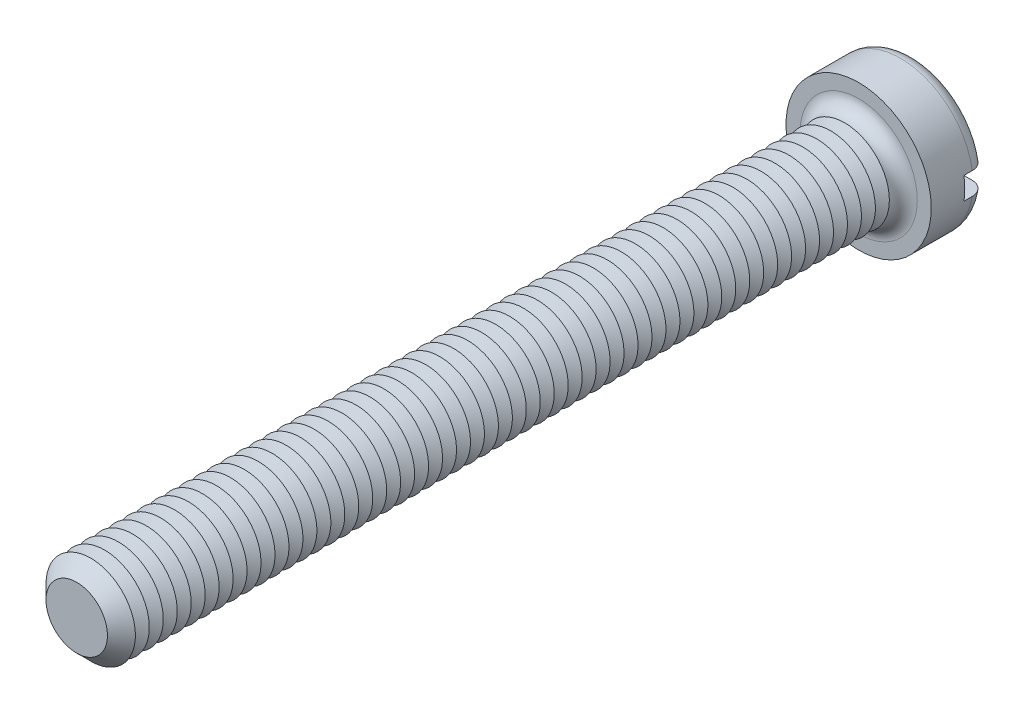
ISO-10303-21;
HEADER;
FILE_DESCRIPTION(('STEP AP214'),'2;1');
FILE_NAME('part.step','',(''),(''),'','','');
FILE_SCHEMA(('AUTOMOTIVE_DESIGN { 1 0 10303 214 1 1 1 1 }'));
ENDSEC;
DATA;
#1=APPLICATION_CONTEXT('core data for automotive mechanical design processes');
#2=APPLICATION_PROTOCOL_DEFINITION('international standard','automotive_design',2000,#1);
#3=PRODUCT_CONTEXT('',#1,'mechanical');
#4=PRODUCT('Part','Part','',(#3));
#5=PRODUCT_RELATED_PRODUCT_CATEGORY('part','',(#4));
#6=PRODUCT_DEFINITION_FORMATION('','',#4);
#7=PRODUCT_DEFINITION_CONTEXT('part definition',#1,'design');
#8=PRODUCT_DEFINITION('design','',#6,#7);
#9=PRODUCT_DEFINITION_SHAPE('','',#8);
#10=(LENGTH_UNIT() NAMED_UNIT(*) SI_UNIT(.MILLI.,.METRE.));
#11=(NAMED_UNIT(*) PLANE_ANGLE_UNIT() SI_UNIT($,.RADIAN.));
#12=(NAMED_UNIT(*) SI_UNIT($,.STERADIAN.) SOLID_ANGLE_UNIT());
#13=UNCERTAINTY_MEASURE_WITH_UNIT(LENGTH_MEASURE(1.E-05),#10,'distance_accuracy_value','');
#14=(GEOMETRIC_REPRESENTATION_CONTEXT(3) GLOBAL_UNCERTAINTY_ASSIGNED_CONTEXT((#13)) GLOBAL_UNIT_ASSIGNED_CONTEXT((#10,
#11,#12)) REPRESENTATION_CONTEXT('',''));
#15=CARTESIAN_POINT('',(0.,0.,0.));
#16=DIRECTION('',(0.,0.,1.));
#17=DIRECTION('',(1.,0.,0.));
#18=AXIS2_PLACEMENT_3D('',#15,#16,#17);
#19=CARTESIAN_POINT('',(0.,0.,-5.));
#20=DIRECTION('',(0.,0.,1.));
#21=DIRECTION('',(1.,0.,0.));
#22=AXIS2_PLACEMENT_3D('',#19,#20,#21);
#23=PLANE('',#22);
#24=CARTESIAN_POINT('',(0.,0.,-5.));
#25=DIRECTION('',(0.,0.,1.));
#26=DIRECTION('',(1.,0.,0.));
#27=AXIS2_PLACEMENT_3D('',#24,#25,#26);
#28=CIRCLE('',#27,5.25);
#29=CARTESIAN_POINT('',(-5.15388203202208,1.,-5.));
#30=VERTEX_POINT('',#29);
#31=CARTESIAN_POINT('',(5.15388203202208,1.,-5.));
#32=VERTEX_POINT('',#31);
#33=EDGE_CURVE('E116',#30,#32,#28,.F.);
#34=ORIENTED_EDGE('',*,*,#33,.T.);
#35=DIRECTION('',(1.,0.,0.));
#36=VECTOR('',#35,1.);
#37=CARTESIAN_POINT('',(-6.5,1.,-5.));
#38=LINE('',#37,#36);
#39=EDGE_CURVE('E111',#30,#32,#38,.T.);
#40=ORIENTED_EDGE('',*,*,#39,.F.);
#41=EDGE_LOOP('',(#34,#40));
#42=FACE_BOUND('',#41,.T.);
#43=ADVANCED_FACE('F39',(#42),#23,.F.);
#44=CARTESIAN_POINT('',(0.,0.,-3.75));
#45=DIRECTION('',(0.,0.,1.));
#46=DIRECTION('',(1.,0.,0.));
#47=AXIS2_PLACEMENT_3D('',#44,#45,#46);
#48=TOROIDAL_SURFACE('',#47,5.25,1.25);
#49=CARTESIAN_POINT('',(-6.04655789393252,1.,-4.63904490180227));
#50=CARTESIAN_POINT('',(-5.99546860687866,1.,-4.68885774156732));
#51=CARTESIAN_POINT('',(-5.94008472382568,1.,-4.73434760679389));
#52=CARTESIAN_POINT('',(-5.8223927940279,1.,-4.81538052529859));
#53=CARTESIAN_POINT('',(-5.7600753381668,1.,-4.85090982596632));
#54=CARTESIAN_POINT('',(-5.63044351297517,1.,-4.91100606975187));
#55=CARTESIAN_POINT('',(-5.56313479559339,1.,-4.93558519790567));
#56=CARTESIAN_POINT('',(-5.42539577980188,1.,-4.97322457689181));
#57=CARTESIAN_POINT('',(-5.35496625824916,1.,-4.98628767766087));
#58=CARTESIAN_POINT('',(-5.21212635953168,1.,-5.00070478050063));
#59=CARTESIAN_POINT('',(-5.13970265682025,1.,-5.00192674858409));
#60=CARTESIAN_POINT('',(-4.99565121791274,1.,-4.99234085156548));
#61=CARTESIAN_POINT('',(-4.92402357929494,1.,-4.98153152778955));
#62=CARTESIAN_POINT('',(-4.78274786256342,1.,-4.94801424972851));
#63=CARTESIAN_POINT('',(-4.71313137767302,1.,-4.92517296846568));
#64=CARTESIAN_POINT('',(-4.57871041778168,1.,-4.86813760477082));
#65=CARTESIAN_POINT('',(-4.51390612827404,1.,-4.83394308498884));
#66=CARTESIAN_POINT('',(-4.39095493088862,1.,-4.75508341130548));
#67=CARTESIAN_POINT('',(-4.33281197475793,1.,-4.7104120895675));
#68=CARTESIAN_POINT('',(-4.22499800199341,1.,-4.61179869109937));
#69=CARTESIAN_POINT('',(-4.17532640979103,1.,-4.55785724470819));
#70=CARTESIAN_POINT('',(-4.08677450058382,1.,-4.4431082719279));
#71=CARTESIAN_POINT('',(-4.0477350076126,1.,-4.38242369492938));
#72=CARTESIAN_POINT('',(-3.98074296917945,1.,-4.25521412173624));
#73=CARTESIAN_POINT('',(-3.95278836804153,1.,-4.18869021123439));
#74=CARTESIAN_POINT('',(-3.90959497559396,1.,-4.0537026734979));
#75=CARTESIAN_POINT('',(-3.89401985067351,1.,-3.98534663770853));
#76=CARTESIAN_POINT('',(-3.8748586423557,1.,-3.84697740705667));
#77=CARTESIAN_POINT('',(-3.87127067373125,1.,-3.7769644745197));
#78=CARTESIAN_POINT('',(-3.8761573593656,1.,-3.63892215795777));
#79=CARTESIAN_POINT('',(-3.88436651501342,1.,-3.57088319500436));
#80=CARTESIAN_POINT('',(-3.91207743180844,1.,-3.43714958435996));
#81=CARTESIAN_POINT('',(-3.93157911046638,1.,-3.37145491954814));
#82=CARTESIAN_POINT('',(-3.98125045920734,1.,-3.24411474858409));
#83=CARTESIAN_POINT('',(-4.01143761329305,1.,-3.18247607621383));
#84=CARTESIAN_POINT('',(-4.08150210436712,1.,-3.064981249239));
#85=CARTESIAN_POINT('',(-4.12138048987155,1.,-3.0091257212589));
#86=CARTESIAN_POINT('',(-4.2106718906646,1.,-2.90336353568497));
#87=CARTESIAN_POINT('',(-4.26028693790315,1.,-2.85362751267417));
#88=CARTESIAN_POINT('',(-4.36696587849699,1.,-2.76291710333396));
#89=CARTESIAN_POINT('',(-4.42403082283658,1.,-2.72194395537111));
#90=CARTESIAN_POINT('',(-4.54567957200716,1.,-2.64877280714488));
#91=CARTESIAN_POINT('',(-4.61042643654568,1.,-2.61684571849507));
#92=CARTESIAN_POINT('',(-4.74430563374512,1.,-2.56412359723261));
#93=CARTESIAN_POINT('',(-4.81343838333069,1.,-2.54332962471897));
#94=CARTESIAN_POINT('',(-4.95527237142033,1.,-2.51320471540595));
#95=CARTESIAN_POINT('',(-5.0280120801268,1.,-2.50405449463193));
#96=CARTESIAN_POINT('',(-5.17399775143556,1.,-2.49810126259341));
#97=CARTESIAN_POINT('',(-5.24724372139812,1.,-2.50129843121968));
#98=CARTESIAN_POINT('',(-5.3921014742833,1.,-2.52000776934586));
#99=CARTESIAN_POINT('',(-5.4637142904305,1.,-2.53551191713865));
#100=CARTESIAN_POINT('',(-5.60326680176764,1.,-2.57846304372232));
#101=CARTESIAN_POINT('',(-5.67120668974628,1.,-2.60590939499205));
#102=CARTESIAN_POINT('',(-5.80064060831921,1.,-2.67164926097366));
#103=CARTESIAN_POINT('',(-5.862199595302,1.,-2.7098148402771));
#104=CARTESIAN_POINT('',(-5.9779079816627,1.,-2.79608690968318));
#105=CARTESIAN_POINT('',(-6.03205795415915,1.,-2.84419263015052));
#106=CARTESIAN_POINT('',(-6.13055119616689,1.,-2.94820522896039));
#107=CARTESIAN_POINT('',(-6.17502887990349,1.,-3.00398483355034));
#108=CARTESIAN_POINT('',(-6.25384180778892,1.,-3.12230113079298));
#109=CARTESIAN_POINT('',(-6.28817779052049,1.,-3.18483733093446));
#110=CARTESIAN_POINT('',(-6.34527986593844,1.,-3.31401726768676));
#111=CARTESIAN_POINT('',(-6.36818984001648,1.,-3.38059742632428));
#112=CARTESIAN_POINT('',(-6.40240470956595,1.,-3.5166725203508));
#113=CARTESIAN_POINT('',(-6.41371067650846,1.,-3.58616718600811));
#114=CARTESIAN_POINT('',(-6.42433240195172,1.,-3.72550026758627));
#115=CARTESIAN_POINT('',(-6.4237441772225,1.,-3.79533138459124));
#116=CARTESIAN_POINT('',(-6.41082814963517,1.,-3.93391789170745));
#117=CARTESIAN_POINT('',(-6.39849757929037,1.,-4.00267302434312));
#118=CARTESIAN_POINT('',(-6.36249191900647,1.,-4.13704597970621));
#119=CARTESIAN_POINT('',(-6.33883072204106,1.,-4.20266753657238));
#120=CARTESIAN_POINT('',(-6.28088769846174,1.,-4.32897165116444));
#121=CARTESIAN_POINT('',(-6.24661890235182,1.,-4.38966015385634));
#122=CARTESIAN_POINT('',(-6.18404039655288,1.,-4.48163773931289));
#123=CARTESIAN_POINT('',(-6.15876600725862,1.,-4.51503333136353));
#124=CARTESIAN_POINT('',(-6.10500607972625,1.,-4.5791298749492));
#125=CARTESIAN_POINT('',(-6.07652056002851,1.,-4.60983084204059));
#126=CARTESIAN_POINT('',(-6.04655789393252,1.,-4.63904490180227));
#127=B_SPLINE_CURVE_WITH_KNOTS('',3,(#49,#50,#51,#52,#53,#54,#55,#56,#57,#58,#59,#60,#61,#62,
#63,#64,#65,#66,#67,#68,#69,#70,#71,#72,#73,#74,#75,#76,#77,#78,#79,#80,#81,#82,#83,#84,#85,#86,
#87,#88,#89,#90,#91,#92,#93,#94,#95,#96,#97,#98,#99,#100,#101,#102,#103,#104,#105,#106,#107,
#108,#109,#110,#111,#112,#113,#114,#115,#116,#117,#118,#119,#120,#121,#122,#123,#124,#125,#126),
.UNSPECIFIED.,.T.,.F.,(4,2,2,2,2,2,2,2,2,2,2,2,2,2,2,2,2,2,2,2,2,2,2,2,2,2,2,2,2,2,2,2,2,2,2,2,
2,2,4),(0.,0.213907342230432,0.428108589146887,0.642070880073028,0.855980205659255,
1.07227200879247,1.28859003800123,1.50735715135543,1.72613269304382,1.94503735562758,
2.16392713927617,2.37933295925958,2.59469881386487,2.80399176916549,3.01325180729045,
3.2178754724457,3.42249764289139,3.62745618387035,3.83243690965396,4.04223444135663,
4.25206160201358,4.46763253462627,4.68322399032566,4.90212226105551,5.12102372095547,
5.33978261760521,5.55853002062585,5.77477015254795,5.99099354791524,6.20398686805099,
6.41696467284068,6.62718821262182,6.83739233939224,7.0459002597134,7.25445733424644,
7.46275934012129,7.67080647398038,7.79625882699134,7.92171045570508),.UNSPECIFIED.);
#128=CARTESIAN_POINT('',(-6.42261628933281,1.,-3.74999999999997));
#129=VERTEX_POINT('',#128);
#130=EDGE_CURVE('E611',#129,#30,#127,.T.);
#131=ORIENTED_EDGE('',*,*,#130,.F.);
#132=CARTESIAN_POINT('',(0.,0.,-3.75));
#133=DIRECTION('',(0.,0.,1.));
#134=DIRECTION('',(1.,0.,0.));
#135=AXIS2_PLACEMENT_3D('',#132,#133,#134);
#136=CIRCLE('',#135,6.5);
#137=CARTESIAN_POINT('',(6.42261628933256,1.,-3.75));
#138=VERTEX_POINT('',#137);
#139=EDGE_CURVE('E125',#138,#129,#136,.T.);
#140=ORIENTED_EDGE('',*,*,#139,.F.);
#141=CARTESIAN_POINT('',(4.06944999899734,1.,-4.4133199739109));
#142=CARTESIAN_POINT('',(4.10828271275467,1.,-4.47354709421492));
#143=CARTESIAN_POINT('',(4.15233880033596,1.,-4.53047894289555));
#144=CARTESIAN_POINT('',(4.24946916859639,1.,-4.63614530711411));
#145=CARTESIAN_POINT('',(4.3025574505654,1.,-4.68486685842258));
#146=CARTESIAN_POINT('',(4.41603250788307,1.,-4.77271114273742));
#147=CARTESIAN_POINT('',(4.47640839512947,1.,-4.8118479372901));
#148=CARTESIAN_POINT('',(4.60277035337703,1.,-4.87959878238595));
#149=CARTESIAN_POINT('',(4.66875480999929,1.,-4.90821584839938));
#150=CARTESIAN_POINT('',(4.80558589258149,1.,-4.95456537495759));
#151=CARTESIAN_POINT('',(4.87649196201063,1.,-4.97212253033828));
#152=CARTESIAN_POINT('',(5.02024710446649,1.,-4.99514979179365));
#153=CARTESIAN_POINT('',(5.09309636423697,1.,-5.00061873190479));
#154=CARTESIAN_POINT('',(5.23902872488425,1.,-4.99926689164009));
#155=CARTESIAN_POINT('',(5.31211131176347,1.,-4.99238812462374));
#156=CARTESIAN_POINT('',(5.45605806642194,1.,-4.96635140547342));
#157=CARTESIAN_POINT('',(5.52692231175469,1.,-4.94719388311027));
#158=CARTESIAN_POINT('',(5.66376170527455,1.,-4.89728421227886));
#159=CARTESIAN_POINT('',(5.72977335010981,1.,-4.86663219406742));
#160=CARTESIAN_POINT('',(5.85560715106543,1.,-4.79452334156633));
#161=CARTESIAN_POINT('',(5.91542977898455,1.,-4.7530673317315));
#162=CARTESIAN_POINT('',(6.02626022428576,1.,-4.66116821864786));
#163=CARTESIAN_POINT('',(6.07738307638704,1.,-4.6108638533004));
#164=CARTESIAN_POINT('',(6.17030947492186,1.,-4.50227823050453));
#165=CARTESIAN_POINT('',(6.2121137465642,1.,-4.44399759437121));
#166=CARTESIAN_POINT('',(6.28460268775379,1.,-4.32200305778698));
#167=CARTESIAN_POINT('',(6.31543589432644,1.,-4.2583773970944));
#168=CARTESIAN_POINT('',(6.36586009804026,1.,-4.12681721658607));
#169=CARTESIAN_POINT('',(6.38545178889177,1.,-4.0588829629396));
#170=CARTESIAN_POINT('',(6.41265760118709,1.,-3.92136007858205));
#171=CARTESIAN_POINT('',(6.42038873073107,1.,-3.85179457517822));
#172=CARTESIAN_POINT('',(6.42401070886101,1.,-3.7123569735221));
#173=CARTESIAN_POINT('',(6.41990193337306,1.,-3.64248488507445));
#174=CARTESIAN_POINT('',(6.40000894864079,1.,-3.50470871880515));
#175=CARTESIAN_POINT('',(6.38427119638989,1.,-3.43679792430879));
#176=CARTESIAN_POINT('',(6.34164491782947,1.,-3.30457296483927));
#177=CARTESIAN_POINT('',(6.31475638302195,1.,-3.24025880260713));
#178=CARTESIAN_POINT('',(6.2505455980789,1.,-3.11686791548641));
#179=CARTESIAN_POINT('',(6.21319759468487,1.,-3.05780459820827));
#180=CARTESIAN_POINT('',(6.12919411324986,1.,-2.94671919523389));
#181=CARTESIAN_POINT('',(6.08253833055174,1.,-2.89469734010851));
#182=CARTESIAN_POINT('',(5.98083387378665,1.,-2.79868150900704));
#183=CARTESIAN_POINT('',(5.92571704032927,1.,-2.75475975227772));
#184=CARTESIAN_POINT('',(5.80897194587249,1.,-2.67665277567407));
#185=CARTESIAN_POINT('',(5.74734329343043,1.,-2.64246814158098));
#186=CARTESIAN_POINT('',(5.6184644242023,1.,-2.58431810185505));
#187=CARTESIAN_POINT('',(5.55115102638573,1.,-2.56049275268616));
#188=CARTESIAN_POINT('',(5.41351272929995,1.,-2.52429868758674));
#189=CARTESIAN_POINT('',(5.34318759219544,1.,-2.51193087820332));
#190=CARTESIAN_POINT('',(5.20041507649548,1.,-2.49882112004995));
#191=CARTESIAN_POINT('',(5.12795169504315,1.,-2.49825332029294));
#192=CARTESIAN_POINT('',(4.98393373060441,1.,-2.50914771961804));
#193=CARTESIAN_POINT('',(4.91237921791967,1.,-2.52061084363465));
#194=CARTESIAN_POINT('',(4.77137358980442,1.,-2.55542281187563));
#195=CARTESIAN_POINT('',(4.70195472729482,1.,-2.57890245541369));
#196=CARTESIAN_POINT('',(4.56803538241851,1.,-2.63717701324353));
#197=CARTESIAN_POINT('',(4.50353509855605,1.,-2.67197238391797));
#198=CARTESIAN_POINT('',(4.38131858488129,1.,-2.7519648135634));
#199=CARTESIAN_POINT('',(4.32360365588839,1.,-2.79716386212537));
#200=CARTESIAN_POINT('',(4.21673400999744,1.,-2.89675634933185));
#201=CARTESIAN_POINT('',(4.16757871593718,1.,-2.95114916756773));
#202=CARTESIAN_POINT('',(4.08014713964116,1.,-3.06667703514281));
#203=CARTESIAN_POINT('',(4.04170608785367,1.,-3.12768727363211));
#204=CARTESIAN_POINT('',(3.97596192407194,1.,-3.25543782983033));
#205=CARTESIAN_POINT('',(3.94865624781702,1.,-3.32217682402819));
#206=CARTESIAN_POINT('',(3.9067737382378,1.,-3.45745603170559));
#207=CARTESIAN_POINT('',(3.89185707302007,1.,-3.52589108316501));
#208=CARTESIAN_POINT('',(3.87400755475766,1.,-3.66432360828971));
#209=CARTESIAN_POINT('',(3.87107601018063,1.,-3.73432125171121));
#210=CARTESIAN_POINT('',(3.8772387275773,1.,-3.87228267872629));
#211=CARTESIAN_POINT('',(3.88607933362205,1.,-3.94025811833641));
#212=CARTESIAN_POINT('',(3.91502769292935,1.,-4.07370133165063));
#213=CARTESIAN_POINT('',(3.93512131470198,1.,-4.1391721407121));
#214=CARTESIAN_POINT('',(3.9752037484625,1.,-4.23926719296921));
#215=CARTESIAN_POINT('',(3.99171171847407,1.,-4.27532618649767));
#216=CARTESIAN_POINT('',(4.02809737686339,1.,-4.34569933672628));
#217=CARTESIAN_POINT('',(4.04797497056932,1.,-4.3800135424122));
#218=CARTESIAN_POINT('',(4.06944999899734,1.,-4.4133199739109));
#219=B_SPLINE_CURVE_WITH_KNOTS('',3,(#141,#142,#143,#144,#145,#146,#147,#148,#149,#150,#151,
#152,#153,#154,#155,#156,#157,#158,#159,#160,#161,#162,#163,#164,#165,#166,#167,#168,#169,#170,
#171,#172,#173,#174,#175,#176,#177,#178,#179,#180,#181,#182,#183,#184,#185,#186,#187,#188,#189,
#190,#191,#192,#193,#194,#195,#196,#197,#198,#199,#200,#201,#202,#203,#204,#205,#206,#207,#208,
#209,#210,#211,#212,#213,#214,#215,#216,#217,#218),.UNSPECIFIED.,.T.,.F.,(4,2,2,2,2,2,2,2,2,2,2,
2,2,2,2,2,2,2,2,2,2,2,2,2,2,2,2,2,2,2,2,2,2,2,2,2,2,2,4),(0.,0.214833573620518,
0.430003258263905,0.644855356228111,0.859645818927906,1.0777603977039,1.29589601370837,
1.51505870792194,1.73421373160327,1.95150241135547,2.16877451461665,2.38290237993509,
2.59701357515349,2.8081044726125,3.01918234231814,3.22816416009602,3.43713934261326,
3.64528416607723,3.85342914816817,4.06209119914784,4.27076008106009,4.48120788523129,
4.69166834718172,4.90489186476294,5.11813225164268,5.33451752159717,5.55091942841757,
5.76972860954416,5.98854661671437,6.20740650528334,6.42625163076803,6.64151774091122,
6.85673425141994,7.0658317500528,7.27495207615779,7.47963858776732,7.68406862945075,
7.80287790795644,7.92168384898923),.UNSPECIFIED.);
#220=EDGE_CURVE('E613',#32,#138,#219,.T.);
#221=ORIENTED_EDGE('',*,*,#220,.F.);
#222=ORIENTED_EDGE('',*,*,#33,.F.);
#223=EDGE_LOOP('',(#131,#140,#221,#222));
#224=FACE_BOUND('',#223,.T.);
#225=ADVANCED_FACE('F595',(#224),#48,.T.);
#226=CARTESIAN_POINT('',(0.,0.,-5.));
#227=DIRECTION('',(0.,0.,1.));
#228=DIRECTION('',(1.,0.,0.));
#229=AXIS2_PLACEMENT_3D('',#226,#227,#228);
#230=CYLINDRICAL_SURFACE('',#229,6.5);
#231=DIRECTION('',(0.,0.,1.));
#232=VECTOR('',#231,1.);
#233=CARTESIAN_POINT('',(6.42261628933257,1.,-5.));
#234=LINE('',#233,#232);
#235=CARTESIAN_POINT('',(6.42261628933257,1.,-3.));
#236=VERTEX_POINT('',#235);
#237=EDGE_CURVE('E629',#138,#236,#234,.T.);
#238=ORIENTED_EDGE('',*,*,#237,.F.);
#239=ORIENTED_EDGE('',*,*,#139,.T.);
#240=DIRECTION('',(0.,0.,1.));
#241=VECTOR('',#240,1.);
#242=CARTESIAN_POINT('',(-6.42261628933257,1.,-5.));
#243=LINE('',#242,#241);
#244=CARTESIAN_POINT('',(-6.42261628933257,1.,-3.));
#245=VERTEX_POINT('',#244);
#246=EDGE_CURVE('E63',#245,#129,#243,.F.);
#247=ORIENTED_EDGE('',*,*,#246,.F.);
#248=CARTESIAN_POINT('',(0.,0.,-3.));
#249=DIRECTION('',(0.,0.,-1.));
#250=DIRECTION('',(-1.,0.,0.));
#251=AXIS2_PLACEMENT_3D('',#248,#249,#250);
#252=CIRCLE('',#251,6.5);
#253=CARTESIAN_POINT('',(-6.42261628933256,-0.999999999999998,-3.));
#254=VERTEX_POINT('',#253);
#255=EDGE_CURVE('E43',#245,#254,#252,.F.);
#256=ORIENTED_EDGE('',*,*,#255,.T.);
#257=DIRECTION('',(0.,0.,1.));
#258=VECTOR('',#257,1.);
#259=CARTESIAN_POINT('',(-6.42261628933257,-0.999999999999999,-5.));
#260=LINE('',#259,#258);
#261=CARTESIAN_POINT('',(-6.42261628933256,-0.999999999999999,-3.75));
#262=VERTEX_POINT('',#261);
#263=EDGE_CURVE('E626',#262,#254,#260,.T.);
#264=ORIENTED_EDGE('',*,*,#263,.F.);
#265=CARTESIAN_POINT('',(6.42261628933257,-1.,-3.75));
#266=VERTEX_POINT('',#265);
#267=EDGE_CURVE('E127',#262,#266,#136,.T.);
#268=ORIENTED_EDGE('',*,*,#267,.T.);
#269=DIRECTION('',(0.,0.,1.));
#270=VECTOR('',#269,1.);
#271=CARTESIAN_POINT('',(6.42261628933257,-1.,-5.));
#272=LINE('',#271,#270);
#273=CARTESIAN_POINT('',(6.42261628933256,-1.,-3.));
#274=VERTEX_POINT('',#273);
#275=EDGE_CURVE('E55',#274,#266,#272,.F.);
#276=ORIENTED_EDGE('',*,*,#275,.F.);
#277=EDGE_CURVE('E11',#274,#236,#252,.F.);
#278=ORIENTED_EDGE('',*,*,#277,.T.);
#279=EDGE_LOOP('',(#238,#239,#247,#256,#264,#268,#276,#278));
#280=FACE_BOUND('',#279,.T.);
#281=CARTESIAN_POINT('',(0.,0.,0.));
#282=DIRECTION('',(0.,0.,1.));
#283=DIRECTION('',(1.,0.,0.));
#284=AXIS2_PLACEMENT_3D('',#281,#282,#283);
#285=CIRCLE('',#284,6.5);
#286=CARTESIAN_POINT('',(6.5,0.,0.));
#287=VERTEX_POINT('',#286);
#288=EDGE_CURVE('E632',#287,#287,#285,.T.);
#289=ORIENTED_EDGE('',*,*,#288,.F.);
#290=EDGE_LOOP('',(#289));
#291=FACE_BOUND('',#290,.T.);
#292=ADVANCED_FACE('F591',(#280,#291),#230,.T.);
#293=CARTESIAN_POINT('',(5.15388203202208,-1.,-5.));
#294=VERTEX_POINT('',#293);
#295=CARTESIAN_POINT('',(-5.15388203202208,-0.999999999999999,-5.));
#296=VERTEX_POINT('',#295);
#297=EDGE_CURVE('E109',#294,#296,#28,.F.);
#298=ORIENTED_EDGE('',*,*,#297,.T.);
#299=DIRECTION('',(-1.,0.,0.));
#300=VECTOR('',#299,1.);
#301=CARTESIAN_POINT('',(-6.5,-0.999999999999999,-5.));
#302=LINE('',#301,#300);
#303=EDGE_CURVE('E96',#294,#296,#302,.T.);
#304=ORIENTED_EDGE('',*,*,#303,.F.);
#305=EDGE_LOOP('',(#298,#304));
#306=FACE_BOUND('',#305,.T.);
#307=ADVANCED_FACE('F108',(#306),#23,.F.);
#308=CARTESIAN_POINT('',(0.,0.,0.));
#309=DIRECTION('',(0.,0.,1.));
#310=DIRECTION('',(1.,0.,0.));
#311=AXIS2_PLACEMENT_3D('',#308,#309,#310);
#312=PLANE('',#311);
#313=CARTESIAN_POINT('',(0.,0.,0.));
#314=DIRECTION('',(0.,0.,1.));
#315=DIRECTION('',(1.,0.,0.));
#316=AXIS2_PLACEMENT_3D('',#313,#314,#315);
#317=CIRCLE('',#316,5.25);
#318=CARTESIAN_POINT('',(5.25,0.,0.));
#319=VERTEX_POINT('',#318);
#320=EDGE_CURVE('E115',#319,#319,#317,.F.);
#321=ORIENTED_EDGE('',*,*,#320,.T.);
#322=EDGE_LOOP('',(#321));
#323=FACE_BOUND('',#322,.T.);
#324=ORIENTED_EDGE('',*,*,#288,.T.);
#325=EDGE_LOOP('',(#324));
#326=FACE_BOUND('',#325,.T.);
#327=ADVANCED_FACE('F590',(#323,#326),#312,.T.);
#328=CARTESIAN_POINT('',(-6.04655789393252,-0.999999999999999,-4.63904490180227));
#329=CARTESIAN_POINT('',(-6.0966604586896,-0.999999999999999,-4.59018532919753));
#330=CARTESIAN_POINT('',(-6.14270501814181,-0.999999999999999,-4.53709744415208));
#331=CARTESIAN_POINT('',(-6.22528519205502,-0.999999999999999,-4.42391631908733));
#332=CARTESIAN_POINT('',(-6.26181074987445,-0.999999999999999,-4.36381576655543));
#333=CARTESIAN_POINT('',(-6.32422109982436,-0.999999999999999,-4.23831836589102));
#334=CARTESIAN_POINT('',(-6.35010658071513,-0.999999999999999,-4.17292186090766));
#335=CARTESIAN_POINT('',(-6.39044668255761,-0.999999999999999,-4.03870925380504));
#336=CARTESIAN_POINT('',(-6.40490396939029,-0.999999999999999,-3.96989395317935));
#337=CARTESIAN_POINT('',(-6.42190814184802,-0.999999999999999,-3.83122595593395));
#338=CARTESIAN_POINT('',(-6.4245257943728,-0.999999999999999,-3.76138193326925));
#339=CARTESIAN_POINT('',(-6.41796432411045,-0.999999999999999,-3.62224935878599));
#340=CARTESIAN_POINT('',(-6.40878509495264,-0.999999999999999,-3.55296081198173));
#341=CARTESIAN_POINT('',(-6.37894560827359,-0.999999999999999,-3.41709241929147));
#342=CARTESIAN_POINT('',(-6.35831520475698,-0.999999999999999,-3.35050601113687));
#343=CARTESIAN_POINT('',(-6.30620980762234,-0.999999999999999,-3.22172312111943));
#344=CARTESIAN_POINT('',(-6.2747347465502,-0.999999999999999,-3.15952666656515));
#345=CARTESIAN_POINT('',(-6.20172710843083,-0.999999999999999,-3.04101762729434));
#346=CARTESIAN_POINT('',(-6.16015622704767,-0.999999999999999,-2.98472864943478));
#347=CARTESIAN_POINT('',(-6.06823774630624,-0.999999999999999,-2.87984578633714));
#348=CARTESIAN_POINT('',(-6.01788981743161,-0.999999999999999,-2.83125219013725));
#349=CARTESIAN_POINT('',(-5.90933830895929,-0.999999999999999,-2.74262118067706));
#350=CARTESIAN_POINT('',(-5.85106338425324,-0.999999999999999,-2.70267117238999));
#351=CARTESIAN_POINT('',(-5.72870702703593,-0.999999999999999,-2.63296796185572));
#352=CARTESIAN_POINT('',(-5.66462521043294,-0.999999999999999,-2.6032154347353));
#353=CARTESIAN_POINT('',(-5.53153273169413,-0.999999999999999,-2.55430842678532));
#354=CARTESIAN_POINT('',(-5.46246626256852,-0.999999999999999,-2.53530583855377));
#355=CARTESIAN_POINT('',(-5.32214267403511,-0.999999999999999,-2.5089831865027));
#356=CARTESIAN_POINT('',(-5.25088537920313,-0.999999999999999,-2.50166406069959));
#357=CARTESIAN_POINT('',(-5.10710123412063,-0.999999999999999,-2.49882202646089));
#358=CARTESIAN_POINT('',(-5.03457095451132,-0.999999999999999,-2.50347166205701));
#359=CARTESIAN_POINT('',(-4.8912897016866,-0.999999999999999,-2.52476029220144));
#360=CARTESIAN_POINT('',(-4.82053886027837,-0.999999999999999,-2.54140017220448));
#361=CARTESIAN_POINT('',(-4.68213257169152,-0.999999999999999,-2.58641614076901));
#362=CARTESIAN_POINT('',(-4.61451256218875,-0.999999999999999,-2.61490131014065));
#363=CARTESIAN_POINT('',(-4.48502801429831,-0.999999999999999,-2.68285095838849));
#364=CARTESIAN_POINT('',(-4.42316359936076,-0.999999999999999,-2.72231567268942));
#365=CARTESIAN_POINT('',(-4.30720694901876,-0.999999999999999,-2.81103994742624));
#366=CARTESIAN_POINT('',(-4.25309118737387,-0.999999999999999,-2.86026872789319));
#367=CARTESIAN_POINT('',(-4.15409408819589,-0.999999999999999,-2.9672764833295));
#368=CARTESIAN_POINT('',(-4.10921182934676,-0.999999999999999,-3.02505460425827));
#369=CARTESIAN_POINT('',(-4.03096584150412,-0.999999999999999,-3.14632492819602));
#370=CARTESIAN_POINT('',(-3.99739097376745,-0.999999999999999,-3.2096807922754));
#371=CARTESIAN_POINT('',(-3.94171839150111,-0.999999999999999,-3.34124912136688));
#372=CARTESIAN_POINT('',(-3.91961840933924,-0.999999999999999,-3.40946062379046));
#373=CARTESIAN_POINT('',(-3.88816636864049,-0.999999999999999,-3.54669256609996));
#374=CARTESIAN_POINT('',(-3.87846562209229,-0.999999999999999,-3.61563318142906));
#375=CARTESIAN_POINT('',(-3.87100568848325,-0.999999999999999,-3.75415397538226));
#376=CARTESIAN_POINT('',(-3.87324501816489,-0.999999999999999,-3.82373407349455));
#377=CARTESIAN_POINT('',(-3.88943589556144,-0.999999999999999,-3.96027701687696));
#378=CARTESIAN_POINT('',(-3.90318225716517,-0.999999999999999,-4.0272643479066));
#379=CARTESIAN_POINT('',(-3.94163954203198,-0.999999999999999,-4.1580093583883));
#380=CARTESIAN_POINT('',(-3.96635075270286,-0.999999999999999,-4.22176695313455));
#381=CARTESIAN_POINT('',(-4.026160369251,-0.999999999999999,-4.34483320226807));
#382=CARTESIAN_POINT('',(-4.06134035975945,-0.999999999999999,-4.40410214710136));
#383=CARTESIAN_POINT('',(-4.14090865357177,-0.999999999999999,-4.51609417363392));
#384=CARTESIAN_POINT('',(-4.18529811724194,-0.999999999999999,-4.56881642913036));
#385=CARTESIAN_POINT('',(-4.2832649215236,-0.999999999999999,-4.66770177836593));
#386=CARTESIAN_POINT('',(-4.33705327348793,-0.999999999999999,-4.71365579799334));
#387=CARTESIAN_POINT('',(-4.45141776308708,-0.999999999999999,-4.79615385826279));
#388=CARTESIAN_POINT('',(-4.51199483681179,-0.999999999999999,-4.83269659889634));
#389=CARTESIAN_POINT('',(-4.63989216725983,-0.999999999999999,-4.89626962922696));
#390=CARTESIAN_POINT('',(-4.70734508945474,-0.999999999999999,-4.92303326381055));
#391=CARTESIAN_POINT('',(-4.84575497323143,-0.999999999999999,-4.96500199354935));
#392=CARTESIAN_POINT('',(-4.91671207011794,-0.999999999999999,-4.98020664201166));
#393=CARTESIAN_POINT('',(-5.06097761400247,-0.999999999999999,-4.9987306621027));
#394=CARTESIAN_POINT('',(-5.13430353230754,-0.999999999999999,-5.00191441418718));
#395=CARTESIAN_POINT('',(-5.28046546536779,-0.999999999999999,-4.99587686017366));
#396=CARTESIAN_POINT('',(-5.35330135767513,-0.999999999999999,-4.98665256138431));
#397=CARTESIAN_POINT('',(-5.49610354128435,-0.999999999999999,-4.95604184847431));
#398=CARTESIAN_POINT('',(-5.56607890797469,-0.999999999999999,-4.93469772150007));
#399=CARTESIAN_POINT('',(-5.70131538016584,-0.999999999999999,-4.88041956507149));
#400=CARTESIAN_POINT('',(-5.76658233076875,-0.999999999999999,-4.84750021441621));
#401=CARTESIAN_POINT('',(-5.86782577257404,-0.999999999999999,-4.78498748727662));
#402=CARTESIAN_POINT('',(-5.90579749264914,-0.999999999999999,-4.75856648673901));
#403=CARTESIAN_POINT('',(-5.97862186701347,-0.999999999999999,-4.70172646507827));
#404=CARTESIAN_POINT('',(-6.0134745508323,-0.999999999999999,-4.6713074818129));
#405=CARTESIAN_POINT('',(-6.04655789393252,-0.999999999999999,-4.63904490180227));
#406=B_SPLINE_CURVE_WITH_KNOTS('',3,(#328,#329,#330,#331,#332,#333,#334,#335,#336,#337,#338,
#339,#340,#341,#342,#343,#344,#345,#346,#347,#348,#349,#350,#351,#352,#353,#354,#355,#356,#357,
#358,#359,#360,#361,#362,#363,#364,#365,#366,#367,#368,#369,#370,#371,#372,#373,#374,#375,#376,
#377,#378,#379,#380,#381,#382,#383,#384,#385,#386,#387,#388,#389,#390,#391,#392,#393,#394,#395,
#396,#397,#398,#399,#400,#401,#402,#403,#404,#405),.UNSPECIFIED.,.T.,.F.,(4,2,2,2,2,2,2,2,2,2,2,
2,2,2,2,2,2,2,2,2,2,2,2,2,2,2,2,2,2,2,2,2,2,2,2,2,2,2,4),(0.,0.209780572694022,
0.419781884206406,0.629769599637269,0.839708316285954,1.04839053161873,1.2570746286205,
1.46521720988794,1.67336108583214,1.88230736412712,2.09126148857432,2.30223890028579,
2.51323027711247,2.72713284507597,2.94105258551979,3.15807345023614,3.37511034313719,
3.59419176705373,3.81327788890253,4.03168404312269,4.25006839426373,4.46411376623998,
4.67811682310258,4.88595885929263,5.09377507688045,5.29796268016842,5.50215563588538,
5.70798353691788,5.91383738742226,6.12510741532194,6.33640661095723,6.55309998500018,
6.76980173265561,6.98894112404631,7.20813337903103,7.42656551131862,7.64472163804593,
7.78324365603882,7.92176436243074),.UNSPECIFIED.);
#407=EDGE_CURVE('E103',#296,#262,#406,.T.);
#408=ORIENTED_EDGE('',*,*,#407,.F.);
#409=ORIENTED_EDGE('',*,*,#297,.F.);
#410=CARTESIAN_POINT('',(4.06944999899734,-1.,-4.4133199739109));
#411=CARTESIAN_POINT('',(4.03213207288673,-1.,-4.3554312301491));
#412=CARTESIAN_POINT('',(3.9995849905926,-1.,-4.29441722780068));
#413=CARTESIAN_POINT('',(3.94511822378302,-1.,-4.16776604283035));
#414=CARTESIAN_POINT('',(3.92320762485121,-1.,-4.10212496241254));
#415=CARTESIAN_POINT('',(3.89078811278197,-1.,-3.96804412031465));
#416=CARTESIAN_POINT('',(3.88028409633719,-1.,-3.89960316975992));
#417=CARTESIAN_POINT('',(3.87107895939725,-1.,-3.76194650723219));
#418=CARTESIAN_POINT('',(3.87237511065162,-1.,-3.69273097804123));
#419=CARTESIAN_POINT('',(3.88662927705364,-1.,-3.55634460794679));
#420=CARTESIAN_POINT('',(3.89944923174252,-1.,-3.48915926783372));
#421=CARTESIAN_POINT('',(3.93611188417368,-1.,-3.35786953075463));
#422=CARTESIAN_POINT('',(3.95995518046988,-1.,-3.29376530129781));
#423=CARTESIAN_POINT('',(4.0180748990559,-1.,-3.16993562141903));
#424=CARTESIAN_POINT('',(4.05242297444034,-1.,-3.11024385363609));
#425=CARTESIAN_POINT('',(4.13041121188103,-1.,-2.9972793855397));
#426=CARTESIAN_POINT('',(4.17405248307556,-1.,-2.94400745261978));
#427=CARTESIAN_POINT('',(4.27058636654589,-1.,-2.8439150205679));
#428=CARTESIAN_POINT('',(4.32368948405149,-1.,-2.79729757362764));
#429=CARTESIAN_POINT('',(4.43679856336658,-1.,-2.71336600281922));
#430=CARTESIAN_POINT('',(4.49680546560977,-1.,-2.67605314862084));
#431=CARTESIAN_POINT('',(4.62370121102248,-1.,-2.61081752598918));
#432=CARTESIAN_POINT('',(4.69072799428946,-1.,-2.58316284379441));
#433=CARTESIAN_POINT('',(4.82843981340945,-1.,-2.5393441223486));
#434=CARTESIAN_POINT('',(4.899125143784,-1.,-2.52318100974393));
#435=CARTESIAN_POINT('',(5.04306377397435,-1.,-2.50267755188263));
#436=CARTESIAN_POINT('',(5.11633773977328,-1.,-2.49848181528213));
#437=CARTESIAN_POINT('',(5.26254809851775,-1.,-2.50249357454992));
#438=CARTESIAN_POINT('',(5.33548449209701,-1.,-2.51070104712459));
#439=CARTESIAN_POINT('',(5.4786703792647,-1.,-2.53930888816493));
#440=CARTESIAN_POINT('',(5.54892819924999,-1.,-2.5596675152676));
#441=CARTESIAN_POINT('',(5.68495799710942,-1.,-2.61204238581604));
#442=CARTESIAN_POINT('',(5.75073024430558,-1.,-2.64405792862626));
#443=CARTESIAN_POINT('',(5.8750178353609,-1.,-2.7184150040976));
#444=CARTESIAN_POINT('',(5.93361487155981,-1.,-2.76061995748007));
#445=CARTESIAN_POINT('',(6.04275377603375,-1.,-2.85440601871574));
#446=CARTESIAN_POINT('',(6.09329629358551,-1.,-2.90598637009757));
#447=CARTESIAN_POINT('',(6.18409572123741,-1.,-3.01622977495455));
#448=CARTESIAN_POINT('',(6.2244945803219,-1.,-3.07477592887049));
#449=CARTESIAN_POINT('',(6.29474798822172,-1.,-3.19788594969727));
#450=CARTESIAN_POINT('',(6.3246032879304,-1.,-3.26244938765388));
#451=CARTESIAN_POINT('',(6.37256001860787,-1.,-3.39491634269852));
#452=CARTESIAN_POINT('',(6.39079949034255,-1.,-3.46276990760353));
#453=CARTESIAN_POINT('',(6.41554133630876,-1.,-3.60058363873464));
#454=CARTESIAN_POINT('',(6.42204424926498,-1.,-3.67054370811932));
#455=CARTESIAN_POINT('',(6.42311237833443,-1.,-3.81007982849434));
#456=CARTESIAN_POINT('',(6.41775799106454,-1.,-3.879655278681));
#457=CARTESIAN_POINT('',(6.39543799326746,-1.,-4.01691664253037));
#458=CARTESIAN_POINT('',(6.3784725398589,-1.,-4.08460258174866));
#459=CARTESIAN_POINT('',(6.33344768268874,-1.,-4.21614537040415));
#460=CARTESIAN_POINT('',(6.30539273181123,-1.,-4.28000374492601));
#461=CARTESIAN_POINT('',(6.23902076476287,-1.,-4.40214140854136));
#462=CARTESIAN_POINT('',(6.20070356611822,-1.,-4.46042059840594));
#463=CARTESIAN_POINT('',(6.11467174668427,-1.,-4.5701315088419));
#464=CARTESIAN_POINT('',(6.06690270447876,-1.,-4.62152053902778));
#465=CARTESIAN_POINT('',(5.96350111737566,-1.,-4.715657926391));
#466=CARTESIAN_POINT('',(5.90786817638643,-1.,-4.75840584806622));
#467=CARTESIAN_POINT('',(5.78965380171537,-1.,-4.8345781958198));
#468=CARTESIAN_POINT('',(5.72700078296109,-1.,-4.86789149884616));
#469=CARTESIAN_POINT('',(5.59704977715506,-1.,-4.92369754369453));
#470=CARTESIAN_POINT('',(5.52975144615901,-1.,-4.94618948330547));
#471=CARTESIAN_POINT('',(5.39137621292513,-1.,-4.98006173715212));
#472=CARTESIAN_POINT('',(5.32025859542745,-1.,-4.99127571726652));
#473=CARTESIAN_POINT('',(5.17715081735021,-1.,-5.00177798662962));
#474=CARTESIAN_POINT('',(5.10516061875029,-1.,-5.00106575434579));
#475=CARTESIAN_POINT('',(4.96131924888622,-1.,-4.98769775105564));
#476=CARTESIAN_POINT('',(4.88948297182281,-1.,-4.97488146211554));
#477=CARTESIAN_POINT('',(4.74893184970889,-1.,-4.93744335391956));
#478=CARTESIAN_POINT('',(4.68021795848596,-1.,-4.91281795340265));
#479=CARTESIAN_POINT('',(4.54744428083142,-1.,-4.8522329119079));
#480=CARTESIAN_POINT('',(4.48341761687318,-1.,-4.81620070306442));
#481=CARTESIAN_POINT('',(4.36244497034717,-1.,-4.73383277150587));
#482=CARTESIAN_POINT('',(4.30549069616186,-1.,-4.68750929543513));
#483=CARTESIAN_POINT('',(4.21823158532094,-1.,-4.60311228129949));
#484=CARTESIAN_POINT('',(4.18544074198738,-1.,-4.56757118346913));
#485=CARTESIAN_POINT('',(4.12413461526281,-1.,-4.49297229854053));
#486=CARTESIAN_POINT('',(4.09561926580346,-1.,-4.45391456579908));
#487=CARTESIAN_POINT('',(4.06944999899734,-1.,-4.4133199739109));
#488=B_SPLINE_CURVE_WITH_KNOTS('',3,(#410,#411,#412,#413,#414,#415,#416,#417,#418,#419,#420,
#421,#422,#423,#424,#425,#426,#427,#428,#429,#430,#431,#432,#433,#434,#435,#436,#437,#438,#439,
#440,#441,#442,#443,#444,#445,#446,#447,#448,#449,#450,#451,#452,#453,#454,#455,#456,#457,#458,
#459,#460,#461,#462,#463,#464,#465,#466,#467,#468,#469,#470,#471,#472,#473,#474,#475,#476,#477,
#478,#479,#480,#481,#482,#483,#484,#485,#486,#487),.UNSPECIFIED.,.T.,.F.,(4,2,2,2,2,2,2,2,2,2,2,
2,2,2,2,2,2,2,2,2,2,2,2,2,2,2,2,2,2,2,2,2,2,2,2,2,2,2,4),(0.,0.206453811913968,0.4130836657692,
0.619802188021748,0.826472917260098,1.03070015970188,1.23493849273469,1.44060223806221,
1.64629054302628,1.85731119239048,2.06836062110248,2.28487349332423,2.5014038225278,
2.72053974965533,2.9396752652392,3.15806230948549,3.37643622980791,3.59203140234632,
3.80760918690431,4.01997696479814,4.23232961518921,4.44210913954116,4.65187903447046,
4.86023097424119,5.06858009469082,5.27684563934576,5.48511488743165,5.69462015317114,
5.90413597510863,6.11602561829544,6.32793096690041,6.54291770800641,6.75791385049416,
6.97580180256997,7.19375587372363,7.41312537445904,7.63223520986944,7.77701357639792,
7.92178970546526),.UNSPECIFIED.);
#489=EDGE_CURVE('E92',#266,#294,#488,.T.);
#490=ORIENTED_EDGE('',*,*,#489,.F.);
#491=ORIENTED_EDGE('',*,*,#267,.F.);
#492=EDGE_LOOP('',(#408,#409,#490,#491));
#493=FACE_BOUND('',#492,.T.);
#494=ADVANCED_FACE('F113',(#493),#48,.T.);
#495=CARTESIAN_POINT('',(0.,0.,1.25));
#496=DIRECTION('',(0.,0.,1.));
#497=DIRECTION('',(1.,0.,0.));
#498=AXIS2_PLACEMENT_3D('',#495,#496,#497);
#499=TOROIDAL_SURFACE('',#498,5.25,1.25);
#500=ORIENTED_EDGE('',*,*,#320,.F.);
#501=EDGE_LOOP('',(#500));
#502=FACE_BOUND('',#501,.T.);
#503=CARTESIAN_POINT('',(0.,0.,1.25));
#504=DIRECTION('',(0.,0.,-1.));
#505=DIRECTION('',(-1.,0.,0.));
#506=AXIS2_PLACEMENT_3D('',#503,#504,#505);
#507=CIRCLE('',#506,4.);
#508=CARTESIAN_POINT('',(-4.,0.,1.25));
#509=VERTEX_POINT('',#508);
#510=EDGE_CURVE('E638',#509,#509,#507,.T.);
#511=ORIENTED_EDGE('',*,*,#510,.T.);
#512=EDGE_LOOP('',(#511));
#513=FACE_BOUND('',#512,.T.);
#514=ADVANCED_FACE('F583',(#502,#513),#499,.F.);
#515=CARTESIAN_POINT('',(0.,0.,1.875));
#516=DIRECTION('',(0.,0.,-1.));
#517=DIRECTION('',(-1.,0.,0.));
#518=AXIS2_PLACEMENT_3D('',#515,#516,#517);
#519=CONICAL_SURFACE('',#518,2.91746824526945,1.0471975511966);
#520=ORIENTED_EDGE('',*,*,#510,.F.);
#521=EDGE_LOOP('',(#520));
#522=FACE_BOUND('',#521,.T.);
#523=CARTESIAN_POINT('',(0.,0.,1.875));
#524=DIRECTION('',(0.,0.,-1.));
#525=DIRECTION('',(-1.,0.,0.));
#526=AXIS2_PLACEMENT_3D('',#523,#524,#525);
#527=CIRCLE('',#526,2.91746824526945);
#528=CARTESIAN_POINT('',(-2.91746824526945,0.,1.875));
#529=VERTEX_POINT('',#528);
#530=EDGE_CURVE('E644',#529,#529,#527,.T.);
#531=ORIENTED_EDGE('',*,*,#530,.T.);
#532=EDGE_LOOP('',(#531));
#533=FACE_BOUND('',#532,.T.);
#534=ADVANCED_FACE('F579',(#522,#533),#519,.T.);
#535=CARTESIAN_POINT('',(0.,0.,2.5));
#536=DIRECTION('',(0.,0.,1.));
#537=DIRECTION('',(1.,0.,0.));
#538=AXIS2_PLACEMENT_3D('',#535,#536,#537);
#539=CONICAL_SURFACE('',#538,4.,1.0471975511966);
#540=ORIENTED_EDGE('',*,*,#530,.F.);
#541=EDGE_LOOP('',(#540));
#542=FACE_BOUND('',#541,.T.);
#543=CARTESIAN_POINT('',(0.,0.,2.5));
#544=DIRECTION('',(0.,0.,-1.));
#545=DIRECTION('',(-1.,0.,0.));
#546=AXIS2_PLACEMENT_3D('',#543,#544,#545);
#547=CIRCLE('',#546,4.);
#548=CARTESIAN_POINT('',(-4.,0.,2.5));
#549=VERTEX_POINT('',#548);
#550=EDGE_CURVE('E650',#549,#549,#547,.T.);
#551=ORIENTED_EDGE('',*,*,#550,.T.);
#552=EDGE_LOOP('',(#551));
#553=FACE_BOUND('',#552,.T.);
#554=ADVANCED_FACE('F575',(#542,#553),#539,.T.);
#555=CARTESIAN_POINT('',(0.,0.,3.125));
#556=DIRECTION('',(0.,0.,-1.));
#557=DIRECTION('',(-1.,0.,0.));
#558=AXIS2_PLACEMENT_3D('',#555,#556,#557);
#559=CONICAL_SURFACE('',#558,2.91746824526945,1.0471975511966);
#560=ORIENTED_EDGE('',*,*,#550,.F.);
#561=EDGE_LOOP('',(#560));
#562=FACE_BOUND('',#561,.T.);
#563=CARTESIAN_POINT('',(0.,0.,3.125));
#564=DIRECTION('',(0.,0.,-1.));
#565=DIRECTION('',(-1.,0.,0.));
#566=AXIS2_PLACEMENT_3D('',#563,#564,#565);
#567=CIRCLE('',#566,2.91746824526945);
#568=CARTESIAN_POINT('',(-2.91746824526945,0.,3.125));
#569=VERTEX_POINT('',#568);
#570=EDGE_CURVE('E654',#569,#569,#567,.T.);
#571=ORIENTED_EDGE('',*,*,#570,.T.);
#572=EDGE_LOOP('',(#571));
#573=FACE_BOUND('',#572,.T.);
#574=ADVANCED_FACE('F571',(#562,#573),#559,.T.);
#575=CARTESIAN_POINT('',(0.,0.,3.75));
#576=DIRECTION('',(0.,0.,1.));
#577=DIRECTION('',(1.,0.,0.));
#578=AXIS2_PLACEMENT_3D('',#575,#576,#577);
#579=CONICAL_SURFACE('',#578,4.,1.0471975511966);
#580=ORIENTED_EDGE('',*,*,#570,.F.);
#581=EDGE_LOOP('',(#580));
#582=FACE_BOUND('',#581,.T.);
#583=CARTESIAN_POINT('',(0.,0.,3.75));
#584=DIRECTION('',(0.,0.,-1.));
#585=DIRECTION('',(-1.,0.,0.));
#586=AXIS2_PLACEMENT_3D('',#583,#584,#585);
#587=CIRCLE('',#586,4.);
#588=CARTESIAN_POINT('',(-4.,0.,3.75));
#589=VERTEX_POINT('',#588);
#590=EDGE_CURVE('E657',#589,#589,#587,.T.);
#591=ORIENTED_EDGE('',*,*,#590,.T.);
#592=EDGE_LOOP('',(#591));
#593=FACE_BOUND('',#592,.T.);
#594=ADVANCED_FACE('F567',(#582,#593),#579,.T.);
#595=CARTESIAN_POINT('',(0.,0.,4.375));
#596=DIRECTION('',(0.,0.,-1.));
#597=DIRECTION('',(-1.,0.,0.));
#598=AXIS2_PLACEMENT_3D('',#595,#596,#597);
#599=CONICAL_SURFACE('',#598,2.91746824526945,1.0471975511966);
#600=ORIENTED_EDGE('',*,*,#590,.F.);
#601=EDGE_LOOP('',(#600));
#602=FACE_BOUND('',#601,.T.);
#603=CARTESIAN_POINT('',(0.,0.,4.375));
#604=DIRECTION('',(0.,0.,-1.));
#605=DIRECTION('',(-1.,0.,0.));
#606=AXIS2_PLACEMENT_3D('',#603,#604,#605);
#607=CIRCLE('',#606,2.91746824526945);
#608=CARTESIAN_POINT('',(-2.91746824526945,0.,4.375));
#609=VERTEX_POINT('',#608);
#610=EDGE_CURVE('E661',#609,#609,#607,.T.);
#611=ORIENTED_EDGE('',*,*,#610,.T.);
#612=EDGE_LOOP('',(#611));
#613=FACE_BOUND('',#612,.T.);
#614=ADVANCED_FACE('F563',(#602,#613),#599,.T.);
#615=CARTESIAN_POINT('',(0.,0.,5.));
#616=DIRECTION('',(0.,0.,1.));
#617=DIRECTION('',(1.,0.,0.));
#618=AXIS2_PLACEMENT_3D('',#615,#616,#617);
#619=CONICAL_SURFACE('',#618,4.,1.0471975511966);
#620=ORIENTED_EDGE('',*,*,#610,.F.);
#621=EDGE_LOOP('',(#620));
#622=FACE_BOUND('',#621,.T.);
#623=CARTESIAN_POINT('',(0.,0.,5.));
#624=DIRECTION('',(0.,0.,-1.));
#625=DIRECTION('',(-1.,0.,0.));
#626=AXIS2_PLACEMENT_3D('',#623,#624,#625);
#627=CIRCLE('',#626,4.);
#628=CARTESIAN_POINT('',(-4.,0.,5.));
#629=VERTEX_POINT('',#628);
#630=EDGE_CURVE('E665',#629,#629,#627,.T.);
#631=ORIENTED_EDGE('',*,*,#630,.T.);
#632=EDGE_LOOP('',(#631));
#633=FACE_BOUND('',#632,.T.);
#634=ADVANCED_FACE('F559',(#622,#633),#619,.T.);
#635=CARTESIAN_POINT('',(0.,0.,5.625));
#636=DIRECTION('',(0.,0.,-1.));
#637=DIRECTION('',(-1.,0.,0.));
#638=AXIS2_PLACEMENT_3D('',#635,#636,#637);
#639=CONICAL_SURFACE('',#638,2.91746824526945,1.0471975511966);
#640=ORIENTED_EDGE('',*,*,#630,.F.);
#641=EDGE_LOOP('',(#640));
#642=FACE_BOUND('',#641,.T.);
#643=CARTESIAN_POINT('',(0.,0.,5.625));
#644=DIRECTION('',(0.,0.,-1.));
#645=DIRECTION('',(-1.,0.,0.));
#646=AXIS2_PLACEMENT_3D('',#643,#644,#645);
#647=CIRCLE('',#646,2.91746824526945);
#648=CARTESIAN_POINT('',(-2.91746824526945,0.,5.625));
#649=VERTEX_POINT('',#648);
#650=EDGE_CURVE('E669',#649,#649,#647,.T.);
#651=ORIENTED_EDGE('',*,*,#650,.T.);
#652=EDGE_LOOP('',(#651));
#653=FACE_BOUND('',#652,.T.);
#654=ADVANCED_FACE('F555',(#642,#653),#639,.T.);
#655=CARTESIAN_POINT('',(0.,0.,6.25));
#656=DIRECTION('',(0.,0.,1.));
#657=DIRECTION('',(1.,0.,0.));
#658=AXIS2_PLACEMENT_3D('',#655,#656,#657);
#659=CONICAL_SURFACE('',#658,4.,1.0471975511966);
#660=ORIENTED_EDGE('',*,*,#650,.F.);
#661=EDGE_LOOP('',(#660));
#662=FACE_BOUND('',#661,.T.);
#663=CARTESIAN_POINT('',(0.,0.,6.25));
#664=DIRECTION('',(0.,0.,-1.));
#665=DIRECTION('',(-1.,0.,0.));
#666=AXIS2_PLACEMENT_3D('',#663,#664,#665);
#667=CIRCLE('',#666,4.);
#668=CARTESIAN_POINT('',(-4.,0.,6.25));
#669=VERTEX_POINT('',#668);
#670=EDGE_CURVE('E673',#669,#669,#667,.T.);
#671=ORIENTED_EDGE('',*,*,#670,.T.);
#672=EDGE_LOOP('',(#671));
#673=FACE_BOUND('',#672,.T.);
#674=ADVANCED_FACE('F551',(#662,#673),#659,.T.);
#675=CARTESIAN_POINT('',(0.,0.,6.875));
#676=DIRECTION('',(0.,0.,-1.));
#677=DIRECTION('',(-1.,0.,0.));
#678=AXIS2_PLACEMENT_3D('',#675,#676,#677);
#679=CONICAL_SURFACE('',#678,2.91746824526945,1.0471975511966);
#680=ORIENTED_EDGE('',*,*,#670,.F.);
#681=EDGE_LOOP('',(#680));
#682=FACE_BOUND('',#681,.T.);
#683=CARTESIAN_POINT('',(0.,0.,6.875));
#684=DIRECTION('',(0.,0.,-1.));
#685=DIRECTION('',(-1.,0.,0.));
#686=AXIS2_PLACEMENT_3D('',#683,#684,#685);
#687=CIRCLE('',#686,2.91746824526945);
#688=CARTESIAN_POINT('',(-2.91746824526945,0.,6.875));
#689=VERTEX_POINT('',#688);
#690=EDGE_CURVE('E677',#689,#689,#687,.T.);
#691=ORIENTED_EDGE('',*,*,#690,.T.);
#692=EDGE_LOOP('',(#691));
#693=FACE_BOUND('',#692,.T.);
#694=ADVANCED_FACE('F547',(#682,#693),#679,.T.);
#695=CARTESIAN_POINT('',(0.,0.,7.5));
#696=DIRECTION('',(0.,0.,1.));
#697=DIRECTION('',(1.,0.,0.));
#698=AXIS2_PLACEMENT_3D('',#695,#696,#697);
#699=CONICAL_SURFACE('',#698,4.,1.0471975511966);
#700=ORIENTED_EDGE('',*,*,#690,.F.);
#701=EDGE_LOOP('',(#700));
#702=FACE_BOUND('',#701,.T.);
#703=CARTESIAN_POINT('',(0.,0.,7.5));
#704=DIRECTION('',(0.,0.,-1.));
#705=DIRECTION('',(-1.,0.,0.));
#706=AXIS2_PLACEMENT_3D('',#703,#704,#705);
#707=CIRCLE('',#706,4.);
#708=CARTESIAN_POINT('',(-4.,0.,7.5));
#709=VERTEX_POINT('',#708);
#710=EDGE_CURVE('E680',#709,#709,#707,.T.);
#711=ORIENTED_EDGE('',*,*,#710,.T.);
#712=EDGE_LOOP('',(#711));
#713=FACE_BOUND('',#712,.T.);
#714=ADVANCED_FACE('F543',(#702,#713),#699,.T.);
#715=CARTESIAN_POINT('',(0.,0.,8.125));
#716=DIRECTION('',(0.,0.,-1.));
#717=DIRECTION('',(-1.,0.,0.));
#718=AXIS2_PLACEMENT_3D('',#715,#716,#717);
#719=CONICAL_SURFACE('',#718,2.91746824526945,1.0471975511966);
#720=ORIENTED_EDGE('',*,*,#710,.F.);
#721=EDGE_LOOP('',(#720));
#722=FACE_BOUND('',#721,.T.);
#723=CARTESIAN_POINT('',(0.,0.,8.125));
#724=DIRECTION('',(0.,0.,-1.));
#725=DIRECTION('',(-1.,0.,0.));
#726=AXIS2_PLACEMENT_3D('',#723,#724,#725);
#727=CIRCLE('',#726,2.91746824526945);
#728=CARTESIAN_POINT('',(-2.91746824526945,0.,8.125));
#729=VERTEX_POINT('',#728);
#730=EDGE_CURVE('E684',#729,#729,#727,.T.);
#731=ORIENTED_EDGE('',*,*,#730,.T.);
#732=EDGE_LOOP('',(#731));
#733=FACE_BOUND('',#732,.T.);
#734=ADVANCED_FACE('F539',(#722,#733),#719,.T.);
#735=CARTESIAN_POINT('',(0.,0.,8.75));
#736=DIRECTION('',(0.,0.,1.));
#737=DIRECTION('',(1.,0.,0.));
#738=AXIS2_PLACEMENT_3D('',#735,#736,#737);
#739=CONICAL_SURFACE('',#738,4.,1.0471975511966);
#740=ORIENTED_EDGE('',*,*,#730,.F.);
#741=EDGE_LOOP('',(#740));
#742=FACE_BOUND('',#741,.T.);
#743=CARTESIAN_POINT('',(0.,0.,8.75));
#744=DIRECTION('',(0.,0.,-1.));
#745=DIRECTION('',(-1.,0.,0.));
#746=AXIS2_PLACEMENT_3D('',#743,#744,#745);
#747=CIRCLE('',#746,4.);
#748=CARTESIAN_POINT('',(-4.,0.,8.75));
#749=VERTEX_POINT('',#748);
#750=EDGE_CURVE('E688',#749,#749,#747,.T.);
#751=ORIENTED_EDGE('',*,*,#750,.T.);
#752=EDGE_LOOP('',(#751));
#753=FACE_BOUND('',#752,.T.);
#754=ADVANCED_FACE('F535',(#742,#753),#739,.T.);
#755=CARTESIAN_POINT('',(0.,0.,9.375));
#756=DIRECTION('',(0.,0.,-1.));
#757=DIRECTION('',(-1.,0.,0.));
#758=AXIS2_PLACEMENT_3D('',#755,#756,#757);
#759=CONICAL_SURFACE('',#758,2.91746824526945,1.0471975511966);
#760=ORIENTED_EDGE('',*,*,#750,.F.);
#761=EDGE_LOOP('',(#760));
#762=FACE_BOUND('',#761,.T.);
#763=CARTESIAN_POINT('',(0.,0.,9.375));
#764=DIRECTION('',(0.,0.,-1.));
#765=DIRECTION('',(-1.,0.,0.));
#766=AXIS2_PLACEMENT_3D('',#763,#764,#765);
#767=CIRCLE('',#766,2.91746824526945);
#768=CARTESIAN_POINT('',(-2.91746824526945,0.,9.375));
#769=VERTEX_POINT('',#768);
#770=EDGE_CURVE('E692',#769,#769,#767,.T.);
#771=ORIENTED_EDGE('',*,*,#770,.T.);
#772=EDGE_LOOP('',(#771));
#773=FACE_BOUND('',#772,.T.);
#774=ADVANCED_FACE('F531',(#762,#773),#759,.T.);
#775=CARTESIAN_POINT('',(0.,0.,10.));
#776=DIRECTION('',(0.,0.,1.));
#777=DIRECTION('',(1.,0.,0.));
#778=AXIS2_PLACEMENT_3D('',#775,#776,#777);
#779=CONICAL_SURFACE('',#778,4.,1.0471975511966);
#780=ORIENTED_EDGE('',*,*,#770,.F.);
#781=EDGE_LOOP('',(#780));
#782=FACE_BOUND('',#781,.T.);
#783=CARTESIAN_POINT('',(0.,0.,10.));
#784=DIRECTION('',(0.,0.,-1.));
#785=DIRECTION('',(-1.,0.,0.));
#786=AXIS2_PLACEMENT_3D('',#783,#784,#785);
#787=CIRCLE('',#786,4.);
#788=CARTESIAN_POINT('',(-4.,0.,10.));
#789=VERTEX_POINT('',#788);
#790=EDGE_CURVE('E696',#789,#789,#787,.T.);
#791=ORIENTED_EDGE('',*,*,#790,.T.);
#792=EDGE_LOOP('',(#791));
#793=FACE_BOUND('',#792,.T.);
#794=ADVANCED_FACE('F527',(#782,#793),#779,.T.);
#795=CARTESIAN_POINT('',(0.,0.,10.625));
#796=DIRECTION('',(0.,0.,-1.));
#797=DIRECTION('',(-1.,0.,0.));
#798=AXIS2_PLACEMENT_3D('',#795,#796,#797);
#799=CONICAL_SURFACE('',#798,2.91746824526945,1.0471975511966);
#800=ORIENTED_EDGE('',*,*,#790,.F.);
#801=EDGE_LOOP('',(#800));
#802=FACE_BOUND('',#801,.T.);
#803=CARTESIAN_POINT('',(0.,0.,10.625));
#804=DIRECTION('',(0.,0.,-1.));
#805=DIRECTION('',(-1.,0.,0.));
#806=AXIS2_PLACEMENT_3D('',#803,#804,#805);
#807=CIRCLE('',#806,2.91746824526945);
#808=CARTESIAN_POINT('',(-2.91746824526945,0.,10.625));
#809=VERTEX_POINT('',#808);
#810=EDGE_CURVE('E700',#809,#809,#807,.T.);
#811=ORIENTED_EDGE('',*,*,#810,.T.);
#812=EDGE_LOOP('',(#811));
#813=FACE_BOUND('',#812,.T.);
#814=ADVANCED_FACE('F523',(#802,#813),#799,.T.);
#815=CARTESIAN_POINT('',(0.,0.,11.25));
#816=DIRECTION('',(0.,0.,1.));
#817=DIRECTION('',(1.,0.,0.));
#818=AXIS2_PLACEMENT_3D('',#815,#816,#817);
#819=CONICAL_SURFACE('',#818,4.,1.0471975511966);
#820=ORIENTED_EDGE('',*,*,#810,.F.);
#821=EDGE_LOOP('',(#820));
#822=FACE_BOUND('',#821,.T.);
#823=CARTESIAN_POINT('',(0.,0.,11.25));
#824=DIRECTION('',(0.,0.,-1.));
#825=DIRECTION('',(-1.,0.,0.));
#826=AXIS2_PLACEMENT_3D('',#823,#824,#825);
#827=CIRCLE('',#826,4.);
#828=CARTESIAN_POINT('',(-4.,0.,11.25));
#829=VERTEX_POINT('',#828);
#830=EDGE_CURVE('E704',#829,#829,#827,.T.);
#831=ORIENTED_EDGE('',*,*,#830,.T.);
#832=EDGE_LOOP('',(#831));
#833=FACE_BOUND('',#832,.T.);
#834=ADVANCED_FACE('F519',(#822,#833),#819,.T.);
#835=CARTESIAN_POINT('',(0.,0.,11.875));
#836=DIRECTION('',(0.,0.,-1.));
#837=DIRECTION('',(-1.,0.,0.));
#838=AXIS2_PLACEMENT_3D('',#835,#836,#837);
#839=CONICAL_SURFACE('',#838,2.91746824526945,1.0471975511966);
#840=ORIENTED_EDGE('',*,*,#830,.F.);
#841=EDGE_LOOP('',(#840));
#842=FACE_BOUND('',#841,.T.);
#843=CARTESIAN_POINT('',(0.,0.,11.875));
#844=DIRECTION('',(0.,0.,-1.));
#845=DIRECTION('',(-1.,0.,0.));
#846=AXIS2_PLACEMENT_3D('',#843,#844,#845);
#847=CIRCLE('',#846,2.91746824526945);
#848=CARTESIAN_POINT('',(-2.91746824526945,0.,11.875));
#849=VERTEX_POINT('',#848);
#850=EDGE_CURVE('E708',#849,#849,#847,.T.);
#851=ORIENTED_EDGE('',*,*,#850,.T.);
#852=EDGE_LOOP('',(#851));
#853=FACE_BOUND('',#852,.T.);
#854=ADVANCED_FACE('F515',(#842,#853),#839,.T.);
#855=CARTESIAN_POINT('',(0.,0.,12.5));
#856=DIRECTION('',(0.,0.,1.));
#857=DIRECTION('',(1.,0.,0.));
#858=AXIS2_PLACEMENT_3D('',#855,#856,#857);
#859=CONICAL_SURFACE('',#858,4.,1.0471975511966);
#860=ORIENTED_EDGE('',*,*,#850,.F.);
#861=EDGE_LOOP('',(#860));
#862=FACE_BOUND('',#861,.T.);
#863=CARTESIAN_POINT('',(0.,0.,12.5));
#864=DIRECTION('',(0.,0.,-1.));
#865=DIRECTION('',(-1.,0.,0.));
#866=AXIS2_PLACEMENT_3D('',#863,#864,#865);
#867=CIRCLE('',#866,4.);
#868=CARTESIAN_POINT('',(-4.,0.,12.5));
#869=VERTEX_POINT('',#868);
#870=EDGE_CURVE('E712',#869,#869,#867,.T.);
#871=ORIENTED_EDGE('',*,*,#870,.T.);
#872=EDGE_LOOP('',(#871));
#873=FACE_BOUND('',#872,.T.);
#874=ADVANCED_FACE('F511',(#862,#873),#859,.T.);
#875=CARTESIAN_POINT('',(0.,0.,13.125));
#876=DIRECTION('',(0.,0.,-1.));
#877=DIRECTION('',(-1.,0.,0.));
#878=AXIS2_PLACEMENT_3D('',#875,#876,#877);
#879=CONICAL_SURFACE('',#878,2.91746824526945,1.0471975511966);
#880=ORIENTED_EDGE('',*,*,#870,.F.);
#881=EDGE_LOOP('',(#880));
#882=FACE_BOUND('',#881,.T.);
#883=CARTESIAN_POINT('',(0.,0.,13.125));
#884=DIRECTION('',(0.,0.,-1.));
#885=DIRECTION('',(-1.,0.,0.));
#886=AXIS2_PLACEMENT_3D('',#883,#884,#885);
#887=CIRCLE('',#886,2.91746824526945);
#888=CARTESIAN_POINT('',(-2.91746824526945,0.,13.125));
#889=VERTEX_POINT('',#888);
#890=EDGE_CURVE('E716',#889,#889,#887,.T.);
#891=ORIENTED_EDGE('',*,*,#890,.T.);
#892=EDGE_LOOP('',(#891));
#893=FACE_BOUND('',#892,.T.);
#894=ADVANCED_FACE('F507',(#882,#893),#879,.T.);
#895=CARTESIAN_POINT('',(0.,0.,13.75));
#896=DIRECTION('',(0.,0.,1.));
#897=DIRECTION('',(1.,0.,0.));
#898=AXIS2_PLACEMENT_3D('',#895,#896,#897);
#899=CONICAL_SURFACE('',#898,4.,1.0471975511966);
#900=ORIENTED_EDGE('',*,*,#890,.F.);
#901=EDGE_LOOP('',(#900));
#902=FACE_BOUND('',#901,.T.);
#903=CARTESIAN_POINT('',(0.,0.,13.75));
#904=DIRECTION('',(0.,0.,-1.));
#905=DIRECTION('',(-1.,0.,0.));
#906=AXIS2_PLACEMENT_3D('',#903,#904,#905);
#907=CIRCLE('',#906,4.);
#908=CARTESIAN_POINT('',(-4.,0.,13.75));
#909=VERTEX_POINT('',#908);
#910=EDGE_CURVE('E720',#909,#909,#907,.T.);
#911=ORIENTED_EDGE('',*,*,#910,.T.);
#912=EDGE_LOOP('',(#911));
#913=FACE_BOUND('',#912,.T.);
#914=ADVANCED_FACE('F503',(#902,#913),#899,.T.);
#915=CARTESIAN_POINT('',(0.,0.,14.375));
#916=DIRECTION('',(0.,0.,-1.));
#917=DIRECTION('',(-1.,0.,0.));
#918=AXIS2_PLACEMENT_3D('',#915,#916,#917);
#919=CONICAL_SURFACE('',#918,2.91746824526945,1.0471975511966);
#920=ORIENTED_EDGE('',*,*,#910,.F.);
#921=EDGE_LOOP('',(#920));
#922=FACE_BOUND('',#921,.T.);
#923=CARTESIAN_POINT('',(0.,0.,14.375));
#924=DIRECTION('',(0.,0.,-1.));
#925=DIRECTION('',(-1.,0.,0.));
#926=AXIS2_PLACEMENT_3D('',#923,#924,#925);
#927=CIRCLE('',#926,2.91746824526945);
#928=CARTESIAN_POINT('',(-2.91746824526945,0.,14.375));
#929=VERTEX_POINT('',#928);
#930=EDGE_CURVE('E724',#929,#929,#927,.T.);
#931=ORIENTED_EDGE('',*,*,#930,.T.);
#932=EDGE_LOOP('',(#931));
#933=FACE_BOUND('',#932,.T.);
#934=ADVANCED_FACE('F499',(#922,#933),#919,.T.);
#935=CARTESIAN_POINT('',(0.,0.,15.));
#936=DIRECTION('',(0.,0.,1.));
#937=DIRECTION('',(1.,0.,0.));
#938=AXIS2_PLACEMENT_3D('',#935,#936,#937);
#939=CONICAL_SURFACE('',#938,4.,1.0471975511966);
#940=ORIENTED_EDGE('',*,*,#930,.F.);
#941=EDGE_LOOP('',(#940));
#942=FACE_BOUND('',#941,.T.);
#943=CARTESIAN_POINT('',(0.,0.,15.));
#944=DIRECTION('',(0.,0.,-1.));
#945=DIRECTION('',(-1.,0.,0.));
#946=AXIS2_PLACEMENT_3D('',#943,#944,#945);
#947=CIRCLE('',#946,4.);
#948=CARTESIAN_POINT('',(-4.,0.,15.));
#949=VERTEX_POINT('',#948);
#950=EDGE_CURVE('E728',#949,#949,#947,.T.);
#951=ORIENTED_EDGE('',*,*,#950,.T.);
#952=EDGE_LOOP('',(#951));
#953=FACE_BOUND('',#952,.T.);
#954=ADVANCED_FACE('F495',(#942,#953),#939,.T.);
#955=CARTESIAN_POINT('',(0.,0.,15.625));
#956=DIRECTION('',(0.,0.,-1.));
#957=DIRECTION('',(-1.,0.,0.));
#958=AXIS2_PLACEMENT_3D('',#955,#956,#957);
#959=CONICAL_SURFACE('',#958,2.91746824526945,1.0471975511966);
#960=ORIENTED_EDGE('',*,*,#950,.F.);
#961=EDGE_LOOP('',(#960));
#962=FACE_BOUND('',#961,.T.);
#963=CARTESIAN_POINT('',(0.,0.,15.625));
#964=DIRECTION('',(0.,0.,-1.));
#965=DIRECTION('',(-1.,0.,0.));
#966=AXIS2_PLACEMENT_3D('',#963,#964,#965);
#967=CIRCLE('',#966,2.91746824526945);
#968=CARTESIAN_POINT('',(-2.91746824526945,0.,15.625));
#969=VERTEX_POINT('',#968);
#970=EDGE_CURVE('E732',#969,#969,#967,.T.);
#971=ORIENTED_EDGE('',*,*,#970,.T.);
#972=EDGE_LOOP('',(#971));
#973=FACE_BOUND('',#972,.T.);
#974=ADVANCED_FACE('F491',(#962,#973),#959,.T.);
#975=CARTESIAN_POINT('',(0.,0.,16.25));
#976=DIRECTION('',(0.,0.,1.));
#977=DIRECTION('',(1.,0.,0.));
#978=AXIS2_PLACEMENT_3D('',#975,#976,#977);
#979=CONICAL_SURFACE('',#978,4.,1.0471975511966);
#980=ORIENTED_EDGE('',*,*,#970,.F.);
#981=EDGE_LOOP('',(#980));
#982=FACE_BOUND('',#981,.T.);
#983=CARTESIAN_POINT('',(0.,0.,16.25));
#984=DIRECTION('',(0.,0.,-1.));
#985=DIRECTION('',(-1.,0.,0.));
#986=AXIS2_PLACEMENT_3D('',#983,#984,#985);
#987=CIRCLE('',#986,4.);
#988=CARTESIAN_POINT('',(-4.,0.,16.25));
#989=VERTEX_POINT('',#988);
#990=EDGE_CURVE('E735',#989,#989,#987,.T.);
#991=ORIENTED_EDGE('',*,*,#990,.T.);
#992=EDGE_LOOP('',(#991));
#993=FACE_BOUND('',#992,.T.);
#994=ADVANCED_FACE('F487',(#982,#993),#979,.T.);
#995=CARTESIAN_POINT('',(0.,0.,16.875));
#996=DIRECTION('',(0.,0.,-1.));
#997=DIRECTION('',(-1.,0.,0.));
#998=AXIS2_PLACEMENT_3D('',#995,#996,#997);
#999=CONICAL_SURFACE('',#998,2.91746824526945,1.0471975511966);
#1000=ORIENTED_EDGE('',*,*,#990,.F.);
#1001=EDGE_LOOP('',(#1000));
#1002=FACE_BOUND('',#1001,.T.);
#1003=CARTESIAN_POINT('',(0.,0.,16.875));
#1004=DIRECTION('',(0.,0.,-1.));
#1005=DIRECTION('',(-1.,0.,0.));
#1006=AXIS2_PLACEMENT_3D('',#1003,#1004,#1005);
#1007=CIRCLE('',#1006,2.91746824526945);
#1008=CARTESIAN_POINT('',(-2.91746824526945,0.,16.875));
#1009=VERTEX_POINT('',#1008);
#1010=EDGE_CURVE('E739',#1009,#1009,#1007,.T.);
#1011=ORIENTED_EDGE('',*,*,#1010,.T.);
#1012=EDGE_LOOP('',(#1011));
#1013=FACE_BOUND('',#1012,.T.);
#1014=ADVANCED_FACE('F483',(#1002,#1013),#999,.T.);
#1015=CARTESIAN_POINT('',(0.,0.,17.5));
#1016=DIRECTION('',(0.,0.,1.));
#1017=DIRECTION('',(1.,0.,0.));
#1018=AXIS2_PLACEMENT_3D('',#1015,#1016,#1017);
#1019=CONICAL_SURFACE('',#1018,4.,1.0471975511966);
#1020=ORIENTED_EDGE('',*,*,#1010,.F.);
#1021=EDGE_LOOP('',(#1020));
#1022=FACE_BOUND('',#1021,.T.);
#1023=CARTESIAN_POINT('',(0.,0.,17.5));
#1024=DIRECTION('',(0.,0.,-1.));
#1025=DIRECTION('',(-1.,0.,0.));
#1026=AXIS2_PLACEMENT_3D('',#1023,#1024,#1025);
#1027=CIRCLE('',#1026,4.);
#1028=CARTESIAN_POINT('',(-4.,0.,17.5));
#1029=VERTEX_POINT('',#1028);
#1030=EDGE_CURVE('E743',#1029,#1029,#1027,.T.);
#1031=ORIENTED_EDGE('',*,*,#1030,.T.);
#1032=EDGE_LOOP('',(#1031));
#1033=FACE_BOUND('',#1032,.T.);
#1034=ADVANCED_FACE('F479',(#1022,#1033),#1019,.T.);
#1035=CARTESIAN_POINT('',(0.,0.,18.125));
#1036=DIRECTION('',(0.,0.,-1.));
#1037=DIRECTION('',(-1.,0.,0.));
#1038=AXIS2_PLACEMENT_3D('',#1035,#1036,#1037);
#1039=CONICAL_SURFACE('',#1038,2.91746824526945,1.0471975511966);
#1040=ORIENTED_EDGE('',*,*,#1030,.F.);
#1041=EDGE_LOOP('',(#1040));
#1042=FACE_BOUND('',#1041,.T.);
#1043=CARTESIAN_POINT('',(0.,0.,18.125));
#1044=DIRECTION('',(0.,0.,-1.));
#1045=DIRECTION('',(-1.,0.,0.));
#1046=AXIS2_PLACEMENT_3D('',#1043,#1044,#1045);
#1047=CIRCLE('',#1046,2.91746824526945);
#1048=CARTESIAN_POINT('',(-2.91746824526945,0.,18.125));
#1049=VERTEX_POINT('',#1048);
#1050=EDGE_CURVE('E747',#1049,#1049,#1047,.T.);
#1051=ORIENTED_EDGE('',*,*,#1050,.T.);
#1052=EDGE_LOOP('',(#1051));
#1053=FACE_BOUND('',#1052,.T.);
#1054=ADVANCED_FACE('F475',(#1042,#1053),#1039,.T.);
#1055=CARTESIAN_POINT('',(0.,0.,18.75));
#1056=DIRECTION('',(0.,0.,1.));
#1057=DIRECTION('',(1.,0.,0.));
#1058=AXIS2_PLACEMENT_3D('',#1055,#1056,#1057);
#1059=CONICAL_SURFACE('',#1058,4.,1.0471975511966);
#1060=ORIENTED_EDGE('',*,*,#1050,.F.);
#1061=EDGE_LOOP('',(#1060));
#1062=FACE_BOUND('',#1061,.T.);
#1063=CARTESIAN_POINT('',(0.,0.,18.75));
#1064=DIRECTION('',(0.,0.,-1.));
#1065=DIRECTION('',(-1.,0.,0.));
#1066=AXIS2_PLACEMENT_3D('',#1063,#1064,#1065);
#1067=CIRCLE('',#1066,4.);
#1068=CARTESIAN_POINT('',(-4.,0.,18.75));
#1069=VERTEX_POINT('',#1068);
#1070=EDGE_CURVE('E751',#1069,#1069,#1067,.T.);
#1071=ORIENTED_EDGE('',*,*,#1070,.T.);
#1072=EDGE_LOOP('',(#1071));
#1073=FACE_BOUND('',#1072,.T.);
#1074=ADVANCED_FACE('F471',(#1062,#1073),#1059,.T.);
#1075=CARTESIAN_POINT('',(0.,0.,19.375));
#1076=DIRECTION('',(0.,0.,-1.));
#1077=DIRECTION('',(-1.,0.,0.));
#1078=AXIS2_PLACEMENT_3D('',#1075,#1076,#1077);
#1079=CONICAL_SURFACE('',#1078,2.91746824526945,1.0471975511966);
#1080=ORIENTED_EDGE('',*,*,#1070,.F.);
#1081=EDGE_LOOP('',(#1080));
#1082=FACE_BOUND('',#1081,.T.);
#1083=CARTESIAN_POINT('',(0.,0.,19.375));
#1084=DIRECTION('',(0.,0.,-1.));
#1085=DIRECTION('',(-1.,0.,0.));
#1086=AXIS2_PLACEMENT_3D('',#1083,#1084,#1085);
#1087=CIRCLE('',#1086,2.91746824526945);
#1088=CARTESIAN_POINT('',(-2.91746824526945,0.,19.375));
#1089=VERTEX_POINT('',#1088);
#1090=EDGE_CURVE('E755',#1089,#1089,#1087,.T.);
#1091=ORIENTED_EDGE('',*,*,#1090,.T.);
#1092=EDGE_LOOP('',(#1091));
#1093=FACE_BOUND('',#1092,.T.);
#1094=ADVANCED_FACE('F467',(#1082,#1093),#1079,.T.);
#1095=CARTESIAN_POINT('',(0.,0.,20.));
#1096=DIRECTION('',(0.,0.,1.));
#1097=DIRECTION('',(1.,0.,0.));
#1098=AXIS2_PLACEMENT_3D('',#1095,#1096,#1097);
#1099=CONICAL_SURFACE('',#1098,4.,1.0471975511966);
#1100=ORIENTED_EDGE('',*,*,#1090,.F.);
#1101=EDGE_LOOP('',(#1100));
#1102=FACE_BOUND('',#1101,.T.);
#1103=CARTESIAN_POINT('',(0.,0.,20.));
#1104=DIRECTION('',(0.,0.,-1.));
#1105=DIRECTION('',(-1.,0.,0.));
#1106=AXIS2_PLACEMENT_3D('',#1103,#1104,#1105);
#1107=CIRCLE('',#1106,4.);
#1108=CARTESIAN_POINT('',(-4.,0.,20.));
#1109=VERTEX_POINT('',#1108);
#1110=EDGE_CURVE('E759',#1109,#1109,#1107,.T.);
#1111=ORIENTED_EDGE('',*,*,#1110,.T.);
#1112=EDGE_LOOP('',(#1111));
#1113=FACE_BOUND('',#1112,.T.);
#1114=ADVANCED_FACE('F463',(#1102,#1113),#1099,.T.);
#1115=CARTESIAN_POINT('',(0.,0.,20.625));
#1116=DIRECTION('',(0.,0.,-1.));
#1117=DIRECTION('',(-1.,0.,0.));
#1118=AXIS2_PLACEMENT_3D('',#1115,#1116,#1117);
#1119=CONICAL_SURFACE('',#1118,2.91746824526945,1.0471975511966);
#1120=ORIENTED_EDGE('',*,*,#1110,.F.);
#1121=EDGE_LOOP('',(#1120));
#1122=FACE_BOUND('',#1121,.T.);
#1123=CARTESIAN_POINT('',(0.,0.,20.625));
#1124=DIRECTION('',(0.,0.,-1.));
#1125=DIRECTION('',(-1.,0.,0.));
#1126=AXIS2_PLACEMENT_3D('',#1123,#1124,#1125);
#1127=CIRCLE('',#1126,2.91746824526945);
#1128=CARTESIAN_POINT('',(-2.91746824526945,0.,20.625));
#1129=VERTEX_POINT('',#1128);
#1130=EDGE_CURVE('E763',#1129,#1129,#1127,.T.);
#1131=ORIENTED_EDGE('',*,*,#1130,.T.);
#1132=EDGE_LOOP('',(#1131));
#1133=FACE_BOUND('',#1132,.T.);
#1134=ADVANCED_FACE('F459',(#1122,#1133),#1119,.T.);
#1135=CARTESIAN_POINT('',(0.,0.,21.25));
#1136=DIRECTION('',(0.,0.,1.));
#1137=DIRECTION('',(1.,0.,0.));
#1138=AXIS2_PLACEMENT_3D('',#1135,#1136,#1137);
#1139=CONICAL_SURFACE('',#1138,4.,1.0471975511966);
#1140=ORIENTED_EDGE('',*,*,#1130,.F.);
#1141=EDGE_LOOP('',(#1140));
#1142=FACE_BOUND('',#1141,.T.);
#1143=CARTESIAN_POINT('',(0.,0.,21.25));
#1144=DIRECTION('',(0.,0.,-1.));
#1145=DIRECTION('',(-1.,0.,0.));
#1146=AXIS2_PLACEMENT_3D('',#1143,#1144,#1145);
#1147=CIRCLE('',#1146,4.);
#1148=CARTESIAN_POINT('',(-4.,0.,21.25));
#1149=VERTEX_POINT('',#1148);
#1150=EDGE_CURVE('E767',#1149,#1149,#1147,.T.);
#1151=ORIENTED_EDGE('',*,*,#1150,.T.);
#1152=EDGE_LOOP('',(#1151));
#1153=FACE_BOUND('',#1152,.T.);
#1154=ADVANCED_FACE('F455',(#1142,#1153),#1139,.T.);
#1155=CARTESIAN_POINT('',(0.,0.,21.875));
#1156=DIRECTION('',(0.,0.,-1.));
#1157=DIRECTION('',(-1.,0.,0.));
#1158=AXIS2_PLACEMENT_3D('',#1155,#1156,#1157);
#1159=CONICAL_SURFACE('',#1158,2.91746824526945,1.0471975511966);
#1160=ORIENTED_EDGE('',*,*,#1150,.F.);
#1161=EDGE_LOOP('',(#1160));
#1162=FACE_BOUND('',#1161,.T.);
#1163=CARTESIAN_POINT('',(0.,0.,21.875));
#1164=DIRECTION('',(0.,0.,-1.));
#1165=DIRECTION('',(-1.,0.,0.));
#1166=AXIS2_PLACEMENT_3D('',#1163,#1164,#1165);
#1167=CIRCLE('',#1166,2.91746824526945);
#1168=CARTESIAN_POINT('',(-2.91746824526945,0.,21.875));
#1169=VERTEX_POINT('',#1168);
#1170=EDGE_CURVE('E771',#1169,#1169,#1167,.T.);
#1171=ORIENTED_EDGE('',*,*,#1170,.T.);
#1172=EDGE_LOOP('',(#1171));
#1173=FACE_BOUND('',#1172,.T.);
#1174=ADVANCED_FACE('F451',(#1162,#1173),#1159,.T.);
#1175=CARTESIAN_POINT('',(0.,0.,22.5));
#1176=DIRECTION('',(0.,0.,1.));
#1177=DIRECTION('',(1.,0.,0.));
#1178=AXIS2_PLACEMENT_3D('',#1175,#1176,#1177);
#1179=CONICAL_SURFACE('',#1178,4.,1.0471975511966);
#1180=ORIENTED_EDGE('',*,*,#1170,.F.);
#1181=EDGE_LOOP('',(#1180));
#1182=FACE_BOUND('',#1181,.T.);
#1183=CARTESIAN_POINT('',(0.,0.,22.5));
#1184=DIRECTION('',(0.,0.,-1.));
#1185=DIRECTION('',(-1.,0.,0.));
#1186=AXIS2_PLACEMENT_3D('',#1183,#1184,#1185);
#1187=CIRCLE('',#1186,4.);
#1188=CARTESIAN_POINT('',(-4.,0.,22.5));
#1189=VERTEX_POINT('',#1188);
#1190=EDGE_CURVE('E775',#1189,#1189,#1187,.T.);
#1191=ORIENTED_EDGE('',*,*,#1190,.T.);
#1192=EDGE_LOOP('',(#1191));
#1193=FACE_BOUND('',#1192,.T.);
#1194=ADVANCED_FACE('F447',(#1182,#1193),#1179,.T.);
#1195=CARTESIAN_POINT('',(0.,0.,23.125));
#1196=DIRECTION('',(0.,0.,-1.));
#1197=DIRECTION('',(-1.,0.,0.));
#1198=AXIS2_PLACEMENT_3D('',#1195,#1196,#1197);
#1199=CONICAL_SURFACE('',#1198,2.91746824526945,1.0471975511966);
#1200=ORIENTED_EDGE('',*,*,#1190,.F.);
#1201=EDGE_LOOP('',(#1200));
#1202=FACE_BOUND('',#1201,.T.);
#1203=CARTESIAN_POINT('',(0.,0.,23.125));
#1204=DIRECTION('',(0.,0.,-1.));
#1205=DIRECTION('',(-1.,0.,0.));
#1206=AXIS2_PLACEMENT_3D('',#1203,#1204,#1205);
#1207=CIRCLE('',#1206,2.91746824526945);
#1208=CARTESIAN_POINT('',(-2.91746824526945,0.,23.125));
#1209=VERTEX_POINT('',#1208);
#1210=EDGE_CURVE('E778',#1209,#1209,#1207,.T.);
#1211=ORIENTED_EDGE('',*,*,#1210,.T.);
#1212=EDGE_LOOP('',(#1211));
#1213=FACE_BOUND('',#1212,.T.);
#1214=ADVANCED_FACE('F443',(#1202,#1213),#1199,.T.);
#1215=CARTESIAN_POINT('',(0.,0.,23.75));
#1216=DIRECTION('',(0.,0.,1.));
#1217=DIRECTION('',(1.,0.,0.));
#1218=AXIS2_PLACEMENT_3D('',#1215,#1216,#1217);
#1219=CONICAL_SURFACE('',#1218,4.,1.0471975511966);
#1220=ORIENTED_EDGE('',*,*,#1210,.F.);
#1221=EDGE_LOOP('',(#1220));
#1222=FACE_BOUND('',#1221,.T.);
#1223=CARTESIAN_POINT('',(0.,0.,23.75));
#1224=DIRECTION('',(0.,0.,-1.));
#1225=DIRECTION('',(-1.,0.,0.));
#1226=AXIS2_PLACEMENT_3D('',#1223,#1224,#1225);
#1227=CIRCLE('',#1226,4.);
#1228=CARTESIAN_POINT('',(-4.,0.,23.75));
#1229=VERTEX_POINT('',#1228);
#1230=EDGE_CURVE('E782',#1229,#1229,#1227,.T.);
#1231=ORIENTED_EDGE('',*,*,#1230,.T.);
#1232=EDGE_LOOP('',(#1231));
#1233=FACE_BOUND('',#1232,.T.);
#1234=ADVANCED_FACE('F439',(#1222,#1233),#1219,.T.);
#1235=CARTESIAN_POINT('',(0.,0.,24.375));
#1236=DIRECTION('',(0.,0.,-1.));
#1237=DIRECTION('',(-1.,0.,0.));
#1238=AXIS2_PLACEMENT_3D('',#1235,#1236,#1237);
#1239=CONICAL_SURFACE('',#1238,2.91746824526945,1.0471975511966);
#1240=ORIENTED_EDGE('',*,*,#1230,.F.);
#1241=EDGE_LOOP('',(#1240));
#1242=FACE_BOUND('',#1241,.T.);
#1243=CARTESIAN_POINT('',(0.,0.,24.375));
#1244=DIRECTION('',(0.,0.,-1.));
#1245=DIRECTION('',(-1.,0.,0.));
#1246=AXIS2_PLACEMENT_3D('',#1243,#1244,#1245);
#1247=CIRCLE('',#1246,2.91746824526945);
#1248=CARTESIAN_POINT('',(-2.91746824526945,0.,24.375));
#1249=VERTEX_POINT('',#1248);
#1250=EDGE_CURVE('E786',#1249,#1249,#1247,.T.);
#1251=ORIENTED_EDGE('',*,*,#1250,.T.);
#1252=EDGE_LOOP('',(#1251));
#1253=FACE_BOUND('',#1252,.T.);
#1254=ADVANCED_FACE('F435',(#1242,#1253),#1239,.T.);
#1255=CARTESIAN_POINT('',(0.,0.,25.));
#1256=DIRECTION('',(0.,0.,1.));
#1257=DIRECTION('',(1.,0.,0.));
#1258=AXIS2_PLACEMENT_3D('',#1255,#1256,#1257);
#1259=CONICAL_SURFACE('',#1258,4.,1.0471975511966);
#1260=ORIENTED_EDGE('',*,*,#1250,.F.);
#1261=EDGE_LOOP('',(#1260));
#1262=FACE_BOUND('',#1261,.T.);
#1263=CARTESIAN_POINT('',(0.,0.,25.));
#1264=DIRECTION('',(0.,0.,-1.));
#1265=DIRECTION('',(-1.,0.,0.));
#1266=AXIS2_PLACEMENT_3D('',#1263,#1264,#1265);
#1267=CIRCLE('',#1266,4.);
#1268=CARTESIAN_POINT('',(-4.,0.,25.));
#1269=VERTEX_POINT('',#1268);
#1270=EDGE_CURVE('E790',#1269,#1269,#1267,.T.);
#1271=ORIENTED_EDGE('',*,*,#1270,.T.);
#1272=EDGE_LOOP('',(#1271));
#1273=FACE_BOUND('',#1272,.T.);
#1274=ADVANCED_FACE('F431',(#1262,#1273),#1259,.T.);
#1275=CARTESIAN_POINT('',(0.,0.,25.625));
#1276=DIRECTION('',(0.,0.,-1.));
#1277=DIRECTION('',(-1.,0.,0.));
#1278=AXIS2_PLACEMENT_3D('',#1275,#1276,#1277);
#1279=CONICAL_SURFACE('',#1278,2.91746824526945,1.0471975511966);
#1280=ORIENTED_EDGE('',*,*,#1270,.F.);
#1281=EDGE_LOOP('',(#1280));
#1282=FACE_BOUND('',#1281,.T.);
#1283=CARTESIAN_POINT('',(0.,0.,25.625));
#1284=DIRECTION('',(0.,0.,-1.));
#1285=DIRECTION('',(-1.,0.,0.));
#1286=AXIS2_PLACEMENT_3D('',#1283,#1284,#1285);
#1287=CIRCLE('',#1286,2.91746824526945);
#1288=CARTESIAN_POINT('',(-2.91746824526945,0.,25.625));
#1289=VERTEX_POINT('',#1288);
#1290=EDGE_CURVE('E794',#1289,#1289,#1287,.T.);
#1291=ORIENTED_EDGE('',*,*,#1290,.T.);
#1292=EDGE_LOOP('',(#1291));
#1293=FACE_BOUND('',#1292,.T.);
#1294=ADVANCED_FACE('F427',(#1282,#1293),#1279,.T.);
#1295=CARTESIAN_POINT('',(0.,0.,26.25));
#1296=DIRECTION('',(0.,0.,1.));
#1297=DIRECTION('',(1.,0.,0.));
#1298=AXIS2_PLACEMENT_3D('',#1295,#1296,#1297);
#1299=CONICAL_SURFACE('',#1298,4.,1.0471975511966);
#1300=ORIENTED_EDGE('',*,*,#1290,.F.);
#1301=EDGE_LOOP('',(#1300));
#1302=FACE_BOUND('',#1301,.T.);
#1303=CARTESIAN_POINT('',(0.,0.,26.25));
#1304=DIRECTION('',(0.,0.,-1.));
#1305=DIRECTION('',(-1.,0.,0.));
#1306=AXIS2_PLACEMENT_3D('',#1303,#1304,#1305);
#1307=CIRCLE('',#1306,4.);
#1308=CARTESIAN_POINT('',(-4.,0.,26.25));
#1309=VERTEX_POINT('',#1308);
#1310=EDGE_CURVE('E798',#1309,#1309,#1307,.T.);
#1311=ORIENTED_EDGE('',*,*,#1310,.T.);
#1312=EDGE_LOOP('',(#1311));
#1313=FACE_BOUND('',#1312,.T.);
#1314=ADVANCED_FACE('F423',(#1302,#1313),#1299,.T.);
#1315=CARTESIAN_POINT('',(0.,0.,26.875));
#1316=DIRECTION('',(0.,0.,-1.));
#1317=DIRECTION('',(-1.,0.,0.));
#1318=AXIS2_PLACEMENT_3D('',#1315,#1316,#1317);
#1319=CONICAL_SURFACE('',#1318,2.91746824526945,1.0471975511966);
#1320=ORIENTED_EDGE('',*,*,#1310,.F.);
#1321=EDGE_LOOP('',(#1320));
#1322=FACE_BOUND('',#1321,.T.);
#1323=CARTESIAN_POINT('',(0.,0.,26.875));
#1324=DIRECTION('',(0.,0.,-1.));
#1325=DIRECTION('',(-1.,0.,0.));
#1326=AXIS2_PLACEMENT_3D('',#1323,#1324,#1325);
#1327=CIRCLE('',#1326,2.91746824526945);
#1328=CARTESIAN_POINT('',(-2.91746824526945,0.,26.875));
#1329=VERTEX_POINT('',#1328);
#1330=EDGE_CURVE('E802',#1329,#1329,#1327,.T.);
#1331=ORIENTED_EDGE('',*,*,#1330,.T.);
#1332=EDGE_LOOP('',(#1331));
#1333=FACE_BOUND('',#1332,.T.);
#1334=ADVANCED_FACE('F419',(#1322,#1333),#1319,.T.);
#1335=CARTESIAN_POINT('',(0.,0.,27.5));
#1336=DIRECTION('',(0.,0.,1.));
#1337=DIRECTION('',(1.,0.,0.));
#1338=AXIS2_PLACEMENT_3D('',#1335,#1336,#1337);
#1339=CONICAL_SURFACE('',#1338,4.,1.0471975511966);
#1340=ORIENTED_EDGE('',*,*,#1330,.F.);
#1341=EDGE_LOOP('',(#1340));
#1342=FACE_BOUND('',#1341,.T.);
#1343=CARTESIAN_POINT('',(0.,0.,27.5));
#1344=DIRECTION('',(0.,0.,-1.));
#1345=DIRECTION('',(-1.,0.,0.));
#1346=AXIS2_PLACEMENT_3D('',#1343,#1344,#1345);
#1347=CIRCLE('',#1346,4.);
#1348=CARTESIAN_POINT('',(-4.,0.,27.5));
#1349=VERTEX_POINT('',#1348);
#1350=EDGE_CURVE('E806',#1349,#1349,#1347,.T.);
#1351=ORIENTED_EDGE('',*,*,#1350,.T.);
#1352=EDGE_LOOP('',(#1351));
#1353=FACE_BOUND('',#1352,.T.);
#1354=ADVANCED_FACE('F415',(#1342,#1353),#1339,.T.);
#1355=CARTESIAN_POINT('',(0.,0.,28.125));
#1356=DIRECTION('',(0.,0.,-1.));
#1357=DIRECTION('',(-1.,0.,0.));
#1358=AXIS2_PLACEMENT_3D('',#1355,#1356,#1357);
#1359=CONICAL_SURFACE('',#1358,2.91746824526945,1.0471975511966);
#1360=ORIENTED_EDGE('',*,*,#1350,.F.);
#1361=EDGE_LOOP('',(#1360));
#1362=FACE_BOUND('',#1361,.T.);
#1363=CARTESIAN_POINT('',(0.,0.,28.125));
#1364=DIRECTION('',(0.,0.,-1.));
#1365=DIRECTION('',(-1.,0.,0.));
#1366=AXIS2_PLACEMENT_3D('',#1363,#1364,#1365);
#1367=CIRCLE('',#1366,2.91746824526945);
#1368=CARTESIAN_POINT('',(-2.91746824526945,0.,28.125));
#1369=VERTEX_POINT('',#1368);
#1370=EDGE_CURVE('E810',#1369,#1369,#1367,.T.);
#1371=ORIENTED_EDGE('',*,*,#1370,.T.);
#1372=EDGE_LOOP('',(#1371));
#1373=FACE_BOUND('',#1372,.T.);
#1374=ADVANCED_FACE('F411',(#1362,#1373),#1359,.T.);
#1375=CARTESIAN_POINT('',(0.,0.,28.75));
#1376=DIRECTION('',(0.,0.,1.));
#1377=DIRECTION('',(1.,0.,0.));
#1378=AXIS2_PLACEMENT_3D('',#1375,#1376,#1377);
#1379=CONICAL_SURFACE('',#1378,4.,1.0471975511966);
#1380=ORIENTED_EDGE('',*,*,#1370,.F.);
#1381=EDGE_LOOP('',(#1380));
#1382=FACE_BOUND('',#1381,.T.);
#1383=CARTESIAN_POINT('',(0.,0.,28.75));
#1384=DIRECTION('',(0.,0.,-1.));
#1385=DIRECTION('',(-1.,0.,0.));
#1386=AXIS2_PLACEMENT_3D('',#1383,#1384,#1385);
#1387=CIRCLE('',#1386,4.);
#1388=CARTESIAN_POINT('',(-4.,0.,28.75));
#1389=VERTEX_POINT('',#1388);
#1390=EDGE_CURVE('E814',#1389,#1389,#1387,.T.);
#1391=ORIENTED_EDGE('',*,*,#1390,.T.);
#1392=EDGE_LOOP('',(#1391));
#1393=FACE_BOUND('',#1392,.T.);
#1394=ADVANCED_FACE('F407',(#1382,#1393),#1379,.T.);
#1395=CARTESIAN_POINT('',(0.,0.,29.375));
#1396=DIRECTION('',(0.,0.,-1.));
#1397=DIRECTION('',(-1.,0.,0.));
#1398=AXIS2_PLACEMENT_3D('',#1395,#1396,#1397);
#1399=CONICAL_SURFACE('',#1398,2.91746824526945,1.0471975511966);
#1400=ORIENTED_EDGE('',*,*,#1390,.F.);
#1401=EDGE_LOOP('',(#1400));
#1402=FACE_BOUND('',#1401,.T.);
#1403=CARTESIAN_POINT('',(0.,0.,29.375));
#1404=DIRECTION('',(0.,0.,-1.));
#1405=DIRECTION('',(-1.,0.,0.));
#1406=AXIS2_PLACEMENT_3D('',#1403,#1404,#1405);
#1407=CIRCLE('',#1406,2.91746824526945);
#1408=CARTESIAN_POINT('',(-2.91746824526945,0.,29.375));
#1409=VERTEX_POINT('',#1408);
#1410=EDGE_CURVE('E818',#1409,#1409,#1407,.T.);
#1411=ORIENTED_EDGE('',*,*,#1410,.T.);
#1412=EDGE_LOOP('',(#1411));
#1413=FACE_BOUND('',#1412,.T.);
#1414=ADVANCED_FACE('F403',(#1402,#1413),#1399,.T.);
#1415=CARTESIAN_POINT('',(0.,0.,30.));
#1416=DIRECTION('',(0.,0.,1.));
#1417=DIRECTION('',(1.,0.,0.));
#1418=AXIS2_PLACEMENT_3D('',#1415,#1416,#1417);
#1419=CONICAL_SURFACE('',#1418,4.,1.0471975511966);
#1420=ORIENTED_EDGE('',*,*,#1410,.F.);
#1421=EDGE_LOOP('',(#1420));
#1422=FACE_BOUND('',#1421,.T.);
#1423=CARTESIAN_POINT('',(0.,0.,30.));
#1424=DIRECTION('',(0.,0.,-1.));
#1425=DIRECTION('',(-1.,0.,0.));
#1426=AXIS2_PLACEMENT_3D('',#1423,#1424,#1425);
#1427=CIRCLE('',#1426,4.);
#1428=CARTESIAN_POINT('',(-4.,0.,30.));
#1429=VERTEX_POINT('',#1428);
#1430=EDGE_CURVE('E822',#1429,#1429,#1427,.T.);
#1431=ORIENTED_EDGE('',*,*,#1430,.T.);
#1432=EDGE_LOOP('',(#1431));
#1433=FACE_BOUND('',#1432,.T.);
#1434=ADVANCED_FACE('F399',(#1422,#1433),#1419,.T.);
#1435=CARTESIAN_POINT('',(0.,0.,30.625));
#1436=DIRECTION('',(0.,0.,-1.));
#1437=DIRECTION('',(-1.,0.,0.));
#1438=AXIS2_PLACEMENT_3D('',#1435,#1436,#1437);
#1439=CONICAL_SURFACE('',#1438,2.91746824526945,1.0471975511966);
#1440=ORIENTED_EDGE('',*,*,#1430,.F.);
#1441=EDGE_LOOP('',(#1440));
#1442=FACE_BOUND('',#1441,.T.);
#1443=CARTESIAN_POINT('',(0.,0.,30.625));
#1444=DIRECTION('',(0.,0.,-1.));
#1445=DIRECTION('',(-1.,0.,0.));
#1446=AXIS2_PLACEMENT_3D('',#1443,#1444,#1445);
#1447=CIRCLE('',#1446,2.91746824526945);
#1448=CARTESIAN_POINT('',(-2.91746824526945,0.,30.625));
#1449=VERTEX_POINT('',#1448);
#1450=EDGE_CURVE('E826',#1449,#1449,#1447,.T.);
#1451=ORIENTED_EDGE('',*,*,#1450,.T.);
#1452=EDGE_LOOP('',(#1451));
#1453=FACE_BOUND('',#1452,.T.);
#1454=ADVANCED_FACE('F395',(#1442,#1453),#1439,.T.);
#1455=CARTESIAN_POINT('',(0.,0.,31.25));
#1456=DIRECTION('',(0.,0.,1.));
#1457=DIRECTION('',(1.,0.,0.));
#1458=AXIS2_PLACEMENT_3D('',#1455,#1456,#1457);
#1459=CONICAL_SURFACE('',#1458,4.,1.0471975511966);
#1460=ORIENTED_EDGE('',*,*,#1450,.F.);
#1461=EDGE_LOOP('',(#1460));
#1462=FACE_BOUND('',#1461,.T.);
#1463=CARTESIAN_POINT('',(0.,0.,31.25));
#1464=DIRECTION('',(0.,0.,-1.));
#1465=DIRECTION('',(-1.,0.,0.));
#1466=AXIS2_PLACEMENT_3D('',#1463,#1464,#1465);
#1467=CIRCLE('',#1466,4.);
#1468=CARTESIAN_POINT('',(-4.,0.,31.25));
#1469=VERTEX_POINT('',#1468);
#1470=EDGE_CURVE('E830',#1469,#1469,#1467,.T.);
#1471=ORIENTED_EDGE('',*,*,#1470,.T.);
#1472=EDGE_LOOP('',(#1471));
#1473=FACE_BOUND('',#1472,.T.);
#1474=ADVANCED_FACE('F391',(#1462,#1473),#1459,.T.);
#1475=CARTESIAN_POINT('',(0.,0.,31.875));
#1476=DIRECTION('',(0.,0.,-1.));
#1477=DIRECTION('',(-1.,0.,0.));
#1478=AXIS2_PLACEMENT_3D('',#1475,#1476,#1477);
#1479=CONICAL_SURFACE('',#1478,2.91746824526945,1.0471975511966);
#1480=ORIENTED_EDGE('',*,*,#1470,.F.);
#1481=EDGE_LOOP('',(#1480));
#1482=FACE_BOUND('',#1481,.T.);
#1483=CARTESIAN_POINT('',(0.,0.,31.875));
#1484=DIRECTION('',(0.,0.,-1.));
#1485=DIRECTION('',(-1.,0.,0.));
#1486=AXIS2_PLACEMENT_3D('',#1483,#1484,#1485);
#1487=CIRCLE('',#1486,2.91746824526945);
#1488=CARTESIAN_POINT('',(-2.91746824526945,0.,31.875));
#1489=VERTEX_POINT('',#1488);
#1490=EDGE_CURVE('E834',#1489,#1489,#1487,.T.);
#1491=ORIENTED_EDGE('',*,*,#1490,.T.);
#1492=EDGE_LOOP('',(#1491));
#1493=FACE_BOUND('',#1492,.T.);
#1494=ADVANCED_FACE('F387',(#1482,#1493),#1479,.T.);
#1495=CARTESIAN_POINT('',(0.,0.,32.5));
#1496=DIRECTION('',(0.,0.,1.));
#1497=DIRECTION('',(1.,0.,0.));
#1498=AXIS2_PLACEMENT_3D('',#1495,#1496,#1497);
#1499=CONICAL_SURFACE('',#1498,4.,1.0471975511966);
#1500=ORIENTED_EDGE('',*,*,#1490,.F.);
#1501=EDGE_LOOP('',(#1500));
#1502=FACE_BOUND('',#1501,.T.);
#1503=CARTESIAN_POINT('',(0.,0.,32.5));
#1504=DIRECTION('',(0.,0.,-1.));
#1505=DIRECTION('',(-1.,0.,0.));
#1506=AXIS2_PLACEMENT_3D('',#1503,#1504,#1505);
#1507=CIRCLE('',#1506,4.);
#1508=CARTESIAN_POINT('',(-4.,0.,32.5));
#1509=VERTEX_POINT('',#1508);
#1510=EDGE_CURVE('E838',#1509,#1509,#1507,.T.);
#1511=ORIENTED_EDGE('',*,*,#1510,.T.);
#1512=EDGE_LOOP('',(#1511));
#1513=FACE_BOUND('',#1512,.T.);
#1514=ADVANCED_FACE('F383',(#1502,#1513),#1499,.T.);
#1515=CARTESIAN_POINT('',(0.,0.,33.125));
#1516=DIRECTION('',(0.,0.,-1.));
#1517=DIRECTION('',(-1.,0.,0.));
#1518=AXIS2_PLACEMENT_3D('',#1515,#1516,#1517);
#1519=CONICAL_SURFACE('',#1518,2.91746824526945,1.0471975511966);
#1520=ORIENTED_EDGE('',*,*,#1510,.F.);
#1521=EDGE_LOOP('',(#1520));
#1522=FACE_BOUND('',#1521,.T.);
#1523=CARTESIAN_POINT('',(0.,0.,33.125));
#1524=DIRECTION('',(0.,0.,-1.));
#1525=DIRECTION('',(-1.,0.,0.));
#1526=AXIS2_PLACEMENT_3D('',#1523,#1524,#1525);
#1527=CIRCLE('',#1526,2.91746824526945);
#1528=CARTESIAN_POINT('',(-2.91746824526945,0.,33.125));
#1529=VERTEX_POINT('',#1528);
#1530=EDGE_CURVE('E842',#1529,#1529,#1527,.T.);
#1531=ORIENTED_EDGE('',*,*,#1530,.T.);
#1532=EDGE_LOOP('',(#1531));
#1533=FACE_BOUND('',#1532,.T.);
#1534=ADVANCED_FACE('F379',(#1522,#1533),#1519,.T.);
#1535=CARTESIAN_POINT('',(0.,0.,33.75));
#1536=DIRECTION('',(0.,0.,1.));
#1537=DIRECTION('',(1.,0.,0.));
#1538=AXIS2_PLACEMENT_3D('',#1535,#1536,#1537);
#1539=CONICAL_SURFACE('',#1538,4.,1.0471975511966);
#1540=ORIENTED_EDGE('',*,*,#1530,.F.);
#1541=EDGE_LOOP('',(#1540));
#1542=FACE_BOUND('',#1541,.T.);
#1543=CARTESIAN_POINT('',(0.,0.,33.75));
#1544=DIRECTION('',(0.,0.,-1.));
#1545=DIRECTION('',(-1.,0.,0.));
#1546=AXIS2_PLACEMENT_3D('',#1543,#1544,#1545);
#1547=CIRCLE('',#1546,4.);
#1548=CARTESIAN_POINT('',(-4.,0.,33.75));
#1549=VERTEX_POINT('',#1548);
#1550=EDGE_CURVE('E846',#1549,#1549,#1547,.T.);
#1551=ORIENTED_EDGE('',*,*,#1550,.T.);
#1552=EDGE_LOOP('',(#1551));
#1553=FACE_BOUND('',#1552,.T.);
#1554=ADVANCED_FACE('F375',(#1542,#1553),#1539,.T.);
#1555=CARTESIAN_POINT('',(0.,0.,34.375));
#1556=DIRECTION('',(0.,0.,-1.));
#1557=DIRECTION('',(-1.,0.,0.));
#1558=AXIS2_PLACEMENT_3D('',#1555,#1556,#1557);
#1559=CONICAL_SURFACE('',#1558,2.91746824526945,1.0471975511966);
#1560=ORIENTED_EDGE('',*,*,#1550,.F.);
#1561=EDGE_LOOP('',(#1560));
#1562=FACE_BOUND('',#1561,.T.);
#1563=CARTESIAN_POINT('',(0.,0.,34.375));
#1564=DIRECTION('',(0.,0.,-1.));
#1565=DIRECTION('',(-1.,0.,0.));
#1566=AXIS2_PLACEMENT_3D('',#1563,#1564,#1565);
#1567=CIRCLE('',#1566,2.91746824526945);
#1568=CARTESIAN_POINT('',(-2.91746824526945,0.,34.375));
#1569=VERTEX_POINT('',#1568);
#1570=EDGE_CURVE('E850',#1569,#1569,#1567,.T.);
#1571=ORIENTED_EDGE('',*,*,#1570,.T.);
#1572=EDGE_LOOP('',(#1571));
#1573=FACE_BOUND('',#1572,.T.);
#1574=ADVANCED_FACE('F371',(#1562,#1573),#1559,.T.);
#1575=CARTESIAN_POINT('',(0.,0.,35.));
#1576=DIRECTION('',(0.,0.,1.));
#1577=DIRECTION('',(1.,0.,0.));
#1578=AXIS2_PLACEMENT_3D('',#1575,#1576,#1577);
#1579=CONICAL_SURFACE('',#1578,4.,1.0471975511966);
#1580=ORIENTED_EDGE('',*,*,#1570,.F.);
#1581=EDGE_LOOP('',(#1580));
#1582=FACE_BOUND('',#1581,.T.);
#1583=CARTESIAN_POINT('',(0.,0.,35.));
#1584=DIRECTION('',(0.,0.,-1.));
#1585=DIRECTION('',(-1.,0.,0.));
#1586=AXIS2_PLACEMENT_3D('',#1583,#1584,#1585);
#1587=CIRCLE('',#1586,4.);
#1588=CARTESIAN_POINT('',(-4.,0.,35.));
#1589=VERTEX_POINT('',#1588);
#1590=EDGE_CURVE('E854',#1589,#1589,#1587,.T.);
#1591=ORIENTED_EDGE('',*,*,#1590,.T.);
#1592=EDGE_LOOP('',(#1591));
#1593=FACE_BOUND('',#1592,.T.);
#1594=ADVANCED_FACE('F367',(#1582,#1593),#1579,.T.);
#1595=CARTESIAN_POINT('',(0.,0.,35.625));
#1596=DIRECTION('',(0.,0.,-1.));
#1597=DIRECTION('',(-1.,0.,0.));
#1598=AXIS2_PLACEMENT_3D('',#1595,#1596,#1597);
#1599=CONICAL_SURFACE('',#1598,2.91746824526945,1.0471975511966);
#1600=ORIENTED_EDGE('',*,*,#1590,.F.);
#1601=EDGE_LOOP('',(#1600));
#1602=FACE_BOUND('',#1601,.T.);
#1603=CARTESIAN_POINT('',(0.,0.,35.625));
#1604=DIRECTION('',(0.,0.,-1.));
#1605=DIRECTION('',(-1.,0.,0.));
#1606=AXIS2_PLACEMENT_3D('',#1603,#1604,#1605);
#1607=CIRCLE('',#1606,2.91746824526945);
#1608=CARTESIAN_POINT('',(-2.91746824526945,0.,35.625));
#1609=VERTEX_POINT('',#1608);
#1610=EDGE_CURVE('E858',#1609,#1609,#1607,.T.);
#1611=ORIENTED_EDGE('',*,*,#1610,.T.);
#1612=EDGE_LOOP('',(#1611));
#1613=FACE_BOUND('',#1612,.T.);
#1614=ADVANCED_FACE('F363',(#1602,#1613),#1599,.T.);
#1615=CARTESIAN_POINT('',(0.,0.,36.25));
#1616=DIRECTION('',(0.,0.,1.));
#1617=DIRECTION('',(1.,0.,0.));
#1618=AXIS2_PLACEMENT_3D('',#1615,#1616,#1617);
#1619=CONICAL_SURFACE('',#1618,4.,1.0471975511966);
#1620=ORIENTED_EDGE('',*,*,#1610,.F.);
#1621=EDGE_LOOP('',(#1620));
#1622=FACE_BOUND('',#1621,.T.);
#1623=CARTESIAN_POINT('',(0.,0.,36.25));
#1624=DIRECTION('',(0.,0.,-1.));
#1625=DIRECTION('',(-1.,0.,0.));
#1626=AXIS2_PLACEMENT_3D('',#1623,#1624,#1625);
#1627=CIRCLE('',#1626,4.);
#1628=CARTESIAN_POINT('',(-4.,0.,36.25));
#1629=VERTEX_POINT('',#1628);
#1630=EDGE_CURVE('E862',#1629,#1629,#1627,.T.);
#1631=ORIENTED_EDGE('',*,*,#1630,.T.);
#1632=EDGE_LOOP('',(#1631));
#1633=FACE_BOUND('',#1632,.T.);
#1634=ADVANCED_FACE('F359',(#1622,#1633),#1619,.T.);
#1635=CARTESIAN_POINT('',(0.,0.,36.875));
#1636=DIRECTION('',(0.,0.,-1.));
#1637=DIRECTION('',(-1.,0.,0.));
#1638=AXIS2_PLACEMENT_3D('',#1635,#1636,#1637);
#1639=CONICAL_SURFACE('',#1638,2.91746824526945,1.0471975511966);
#1640=ORIENTED_EDGE('',*,*,#1630,.F.);
#1641=EDGE_LOOP('',(#1640));
#1642=FACE_BOUND('',#1641,.T.);
#1643=CARTESIAN_POINT('',(0.,0.,36.875));
#1644=DIRECTION('',(0.,0.,-1.));
#1645=DIRECTION('',(-1.,0.,0.));
#1646=AXIS2_PLACEMENT_3D('',#1643,#1644,#1645);
#1647=CIRCLE('',#1646,2.91746824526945);
#1648=CARTESIAN_POINT('',(-2.91746824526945,0.,36.875));
#1649=VERTEX_POINT('',#1648);
#1650=EDGE_CURVE('E866',#1649,#1649,#1647,.T.);
#1651=ORIENTED_EDGE('',*,*,#1650,.T.);
#1652=EDGE_LOOP('',(#1651));
#1653=FACE_BOUND('',#1652,.T.);
#1654=ADVANCED_FACE('F355',(#1642,#1653),#1639,.T.);
#1655=CARTESIAN_POINT('',(0.,0.,37.5));
#1656=DIRECTION('',(0.,0.,1.));
#1657=DIRECTION('',(1.,0.,0.));
#1658=AXIS2_PLACEMENT_3D('',#1655,#1656,#1657);
#1659=CONICAL_SURFACE('',#1658,4.,1.0471975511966);
#1660=ORIENTED_EDGE('',*,*,#1650,.F.);
#1661=EDGE_LOOP('',(#1660));
#1662=FACE_BOUND('',#1661,.T.);
#1663=CARTESIAN_POINT('',(0.,0.,37.5));
#1664=DIRECTION('',(0.,0.,-1.));
#1665=DIRECTION('',(-1.,0.,0.));
#1666=AXIS2_PLACEMENT_3D('',#1663,#1664,#1665);
#1667=CIRCLE('',#1666,4.);
#1668=CARTESIAN_POINT('',(-4.,0.,37.5));
#1669=VERTEX_POINT('',#1668);
#1670=EDGE_CURVE('E870',#1669,#1669,#1667,.T.);
#1671=ORIENTED_EDGE('',*,*,#1670,.T.);
#1672=EDGE_LOOP('',(#1671));
#1673=FACE_BOUND('',#1672,.T.);
#1674=ADVANCED_FACE('F351',(#1662,#1673),#1659,.T.);
#1675=CARTESIAN_POINT('',(0.,0.,38.125));
#1676=DIRECTION('',(0.,0.,-1.));
#1677=DIRECTION('',(-1.,0.,0.));
#1678=AXIS2_PLACEMENT_3D('',#1675,#1676,#1677);
#1679=CONICAL_SURFACE('',#1678,2.91746824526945,1.0471975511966);
#1680=ORIENTED_EDGE('',*,*,#1670,.F.);
#1681=EDGE_LOOP('',(#1680));
#1682=FACE_BOUND('',#1681,.T.);
#1683=CARTESIAN_POINT('',(0.,0.,38.125));
#1684=DIRECTION('',(0.,0.,-1.));
#1685=DIRECTION('',(-1.,0.,0.));
#1686=AXIS2_PLACEMENT_3D('',#1683,#1684,#1685);
#1687=CIRCLE('',#1686,2.91746824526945);
#1688=CARTESIAN_POINT('',(-2.91746824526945,0.,38.125));
#1689=VERTEX_POINT('',#1688);
#1690=EDGE_CURVE('E874',#1689,#1689,#1687,.T.);
#1691=ORIENTED_EDGE('',*,*,#1690,.T.);
#1692=EDGE_LOOP('',(#1691));
#1693=FACE_BOUND('',#1692,.T.);
#1694=ADVANCED_FACE('F347',(#1682,#1693),#1679,.T.);
#1695=CARTESIAN_POINT('',(0.,0.,38.75));
#1696=DIRECTION('',(0.,0.,1.));
#1697=DIRECTION('',(1.,0.,0.));
#1698=AXIS2_PLACEMENT_3D('',#1695,#1696,#1697);
#1699=CONICAL_SURFACE('',#1698,4.,1.0471975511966);
#1700=ORIENTED_EDGE('',*,*,#1690,.F.);
#1701=EDGE_LOOP('',(#1700));
#1702=FACE_BOUND('',#1701,.T.);
#1703=CARTESIAN_POINT('',(0.,0.,38.75));
#1704=DIRECTION('',(0.,0.,-1.));
#1705=DIRECTION('',(-1.,0.,0.));
#1706=AXIS2_PLACEMENT_3D('',#1703,#1704,#1705);
#1707=CIRCLE('',#1706,4.);
#1708=CARTESIAN_POINT('',(-4.,0.,38.75));
#1709=VERTEX_POINT('',#1708);
#1710=EDGE_CURVE('E878',#1709,#1709,#1707,.T.);
#1711=ORIENTED_EDGE('',*,*,#1710,.T.);
#1712=EDGE_LOOP('',(#1711));
#1713=FACE_BOUND('',#1712,.T.);
#1714=ADVANCED_FACE('F343',(#1702,#1713),#1699,.T.);
#1715=CARTESIAN_POINT('',(0.,0.,39.375));
#1716=DIRECTION('',(0.,0.,-1.));
#1717=DIRECTION('',(-1.,0.,0.));
#1718=AXIS2_PLACEMENT_3D('',#1715,#1716,#1717);
#1719=CONICAL_SURFACE('',#1718,2.91746824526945,1.0471975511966);
#1720=ORIENTED_EDGE('',*,*,#1710,.F.);
#1721=EDGE_LOOP('',(#1720));
#1722=FACE_BOUND('',#1721,.T.);
#1723=CARTESIAN_POINT('',(0.,0.,39.375));
#1724=DIRECTION('',(0.,0.,-1.));
#1725=DIRECTION('',(-1.,0.,0.));
#1726=AXIS2_PLACEMENT_3D('',#1723,#1724,#1725);
#1727=CIRCLE('',#1726,2.91746824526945);
#1728=CARTESIAN_POINT('',(-2.91746824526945,0.,39.375));
#1729=VERTEX_POINT('',#1728);
#1730=EDGE_CURVE('E882',#1729,#1729,#1727,.T.);
#1731=ORIENTED_EDGE('',*,*,#1730,.T.);
#1732=EDGE_LOOP('',(#1731));
#1733=FACE_BOUND('',#1732,.T.);
#1734=ADVANCED_FACE('F339',(#1722,#1733),#1719,.T.);
#1735=CARTESIAN_POINT('',(0.,0.,40.));
#1736=DIRECTION('',(0.,0.,1.));
#1737=DIRECTION('',(1.,0.,0.));
#1738=AXIS2_PLACEMENT_3D('',#1735,#1736,#1737);
#1739=CONICAL_SURFACE('',#1738,4.,1.0471975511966);
#1740=ORIENTED_EDGE('',*,*,#1730,.F.);
#1741=EDGE_LOOP('',(#1740));
#1742=FACE_BOUND('',#1741,.T.);
#1743=CARTESIAN_POINT('',(0.,0.,40.));
#1744=DIRECTION('',(0.,0.,-1.));
#1745=DIRECTION('',(-1.,0.,0.));
#1746=AXIS2_PLACEMENT_3D('',#1743,#1744,#1745);
#1747=CIRCLE('',#1746,4.);
#1748=CARTESIAN_POINT('',(-4.,0.,40.));
#1749=VERTEX_POINT('',#1748);
#1750=EDGE_CURVE('E886',#1749,#1749,#1747,.T.);
#1751=ORIENTED_EDGE('',*,*,#1750,.T.);
#1752=EDGE_LOOP('',(#1751));
#1753=FACE_BOUND('',#1752,.T.);
#1754=ADVANCED_FACE('F335',(#1742,#1753),#1739,.T.);
#1755=CARTESIAN_POINT('',(0.,0.,40.625));
#1756=DIRECTION('',(0.,0.,-1.));
#1757=DIRECTION('',(-1.,0.,0.));
#1758=AXIS2_PLACEMENT_3D('',#1755,#1756,#1757);
#1759=CONICAL_SURFACE('',#1758,2.91746824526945,1.0471975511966);
#1760=ORIENTED_EDGE('',*,*,#1750,.F.);
#1761=EDGE_LOOP('',(#1760));
#1762=FACE_BOUND('',#1761,.T.);
#1763=CARTESIAN_POINT('',(0.,0.,40.625));
#1764=DIRECTION('',(0.,0.,-1.));
#1765=DIRECTION('',(-1.,0.,0.));
#1766=AXIS2_PLACEMENT_3D('',#1763,#1764,#1765);
#1767=CIRCLE('',#1766,2.91746824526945);
#1768=CARTESIAN_POINT('',(-2.91746824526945,0.,40.625));
#1769=VERTEX_POINT('',#1768);
#1770=EDGE_CURVE('E890',#1769,#1769,#1767,.T.);
#1771=ORIENTED_EDGE('',*,*,#1770,.T.);
#1772=EDGE_LOOP('',(#1771));
#1773=FACE_BOUND('',#1772,.T.);
#1774=ADVANCED_FACE('F331',(#1762,#1773),#1759,.T.);
#1775=CARTESIAN_POINT('',(0.,0.,41.25));
#1776=DIRECTION('',(0.,0.,1.));
#1777=DIRECTION('',(1.,0.,0.));
#1778=AXIS2_PLACEMENT_3D('',#1775,#1776,#1777);
#1779=CONICAL_SURFACE('',#1778,4.,1.0471975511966);
#1780=ORIENTED_EDGE('',*,*,#1770,.F.);
#1781=EDGE_LOOP('',(#1780));
#1782=FACE_BOUND('',#1781,.T.);
#1783=CARTESIAN_POINT('',(0.,0.,41.25));
#1784=DIRECTION('',(0.,0.,-1.));
#1785=DIRECTION('',(-1.,0.,0.));
#1786=AXIS2_PLACEMENT_3D('',#1783,#1784,#1785);
#1787=CIRCLE('',#1786,4.);
#1788=CARTESIAN_POINT('',(-4.,0.,41.25));
#1789=VERTEX_POINT('',#1788);
#1790=EDGE_CURVE('E894',#1789,#1789,#1787,.T.);
#1791=ORIENTED_EDGE('',*,*,#1790,.T.);
#1792=EDGE_LOOP('',(#1791));
#1793=FACE_BOUND('',#1792,.T.);
#1794=ADVANCED_FACE('F327',(#1782,#1793),#1779,.T.);
#1795=CARTESIAN_POINT('',(0.,0.,41.875));
#1796=DIRECTION('',(0.,0.,-1.));
#1797=DIRECTION('',(-1.,0.,0.));
#1798=AXIS2_PLACEMENT_3D('',#1795,#1796,#1797);
#1799=CONICAL_SURFACE('',#1798,2.91746824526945,1.0471975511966);
#1800=ORIENTED_EDGE('',*,*,#1790,.F.);
#1801=EDGE_LOOP('',(#1800));
#1802=FACE_BOUND('',#1801,.T.);
#1803=CARTESIAN_POINT('',(0.,0.,41.875));
#1804=DIRECTION('',(0.,0.,-1.));
#1805=DIRECTION('',(-1.,0.,0.));
#1806=AXIS2_PLACEMENT_3D('',#1803,#1804,#1805);
#1807=CIRCLE('',#1806,2.91746824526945);
#1808=CARTESIAN_POINT('',(-2.91746824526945,0.,41.875));
#1809=VERTEX_POINT('',#1808);
#1810=EDGE_CURVE('E898',#1809,#1809,#1807,.T.);
#1811=ORIENTED_EDGE('',*,*,#1810,.T.);
#1812=EDGE_LOOP('',(#1811));
#1813=FACE_BOUND('',#1812,.T.);
#1814=ADVANCED_FACE('F323',(#1802,#1813),#1799,.T.);
#1815=CARTESIAN_POINT('',(0.,0.,42.5));
#1816=DIRECTION('',(0.,0.,1.));
#1817=DIRECTION('',(1.,0.,0.));
#1818=AXIS2_PLACEMENT_3D('',#1815,#1816,#1817);
#1819=CONICAL_SURFACE('',#1818,4.,1.0471975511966);
#1820=ORIENTED_EDGE('',*,*,#1810,.F.);
#1821=EDGE_LOOP('',(#1820));
#1822=FACE_BOUND('',#1821,.T.);
#1823=CARTESIAN_POINT('',(0.,0.,42.5));
#1824=DIRECTION('',(0.,0.,-1.));
#1825=DIRECTION('',(-1.,0.,0.));
#1826=AXIS2_PLACEMENT_3D('',#1823,#1824,#1825);
#1827=CIRCLE('',#1826,4.);
#1828=CARTESIAN_POINT('',(-4.,0.,42.5));
#1829=VERTEX_POINT('',#1828);
#1830=EDGE_CURVE('E902',#1829,#1829,#1827,.T.);
#1831=ORIENTED_EDGE('',*,*,#1830,.T.);
#1832=EDGE_LOOP('',(#1831));
#1833=FACE_BOUND('',#1832,.T.);
#1834=ADVANCED_FACE('F319',(#1822,#1833),#1819,.T.);
#1835=CARTESIAN_POINT('',(0.,0.,43.125));
#1836=DIRECTION('',(0.,0.,-1.));
#1837=DIRECTION('',(-1.,0.,0.));
#1838=AXIS2_PLACEMENT_3D('',#1835,#1836,#1837);
#1839=CONICAL_SURFACE('',#1838,2.91746824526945,1.0471975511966);
#1840=ORIENTED_EDGE('',*,*,#1830,.F.);
#1841=EDGE_LOOP('',(#1840));
#1842=FACE_BOUND('',#1841,.T.);
#1843=CARTESIAN_POINT('',(0.,0.,43.125));
#1844=DIRECTION('',(0.,0.,-1.));
#1845=DIRECTION('',(-1.,0.,0.));
#1846=AXIS2_PLACEMENT_3D('',#1843,#1844,#1845);
#1847=CIRCLE('',#1846,2.91746824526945);
#1848=CARTESIAN_POINT('',(-2.91746824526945,0.,43.125));
#1849=VERTEX_POINT('',#1848);
#1850=EDGE_CURVE('E906',#1849,#1849,#1847,.T.);
#1851=ORIENTED_EDGE('',*,*,#1850,.T.);
#1852=EDGE_LOOP('',(#1851));
#1853=FACE_BOUND('',#1852,.T.);
#1854=ADVANCED_FACE('F315',(#1842,#1853),#1839,.T.);
#1855=CARTESIAN_POINT('',(0.,0.,43.75));
#1856=DIRECTION('',(0.,0.,1.));
#1857=DIRECTION('',(1.,0.,0.));
#1858=AXIS2_PLACEMENT_3D('',#1855,#1856,#1857);
#1859=CONICAL_SURFACE('',#1858,4.,1.0471975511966);
#1860=ORIENTED_EDGE('',*,*,#1850,.F.);
#1861=EDGE_LOOP('',(#1860));
#1862=FACE_BOUND('',#1861,.T.);
#1863=CARTESIAN_POINT('',(0.,0.,43.75));
#1864=DIRECTION('',(0.,0.,-1.));
#1865=DIRECTION('',(-1.,0.,0.));
#1866=AXIS2_PLACEMENT_3D('',#1863,#1864,#1865);
#1867=CIRCLE('',#1866,4.);
#1868=CARTESIAN_POINT('',(-4.,0.,43.75));
#1869=VERTEX_POINT('',#1868);
#1870=EDGE_CURVE('E910',#1869,#1869,#1867,.T.);
#1871=ORIENTED_EDGE('',*,*,#1870,.T.);
#1872=EDGE_LOOP('',(#1871));
#1873=FACE_BOUND('',#1872,.T.);
#1874=ADVANCED_FACE('F311',(#1862,#1873),#1859,.T.);
#1875=CARTESIAN_POINT('',(0.,0.,44.375));
#1876=DIRECTION('',(0.,0.,-1.));
#1877=DIRECTION('',(-1.,0.,0.));
#1878=AXIS2_PLACEMENT_3D('',#1875,#1876,#1877);
#1879=CONICAL_SURFACE('',#1878,2.91746824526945,1.0471975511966);
#1880=ORIENTED_EDGE('',*,*,#1870,.F.);
#1881=EDGE_LOOP('',(#1880));
#1882=FACE_BOUND('',#1881,.T.);
#1883=CARTESIAN_POINT('',(0.,0.,44.375));
#1884=DIRECTION('',(0.,0.,-1.));
#1885=DIRECTION('',(-1.,0.,0.));
#1886=AXIS2_PLACEMENT_3D('',#1883,#1884,#1885);
#1887=CIRCLE('',#1886,2.91746824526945);
#1888=CARTESIAN_POINT('',(-2.91746824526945,0.,44.375));
#1889=VERTEX_POINT('',#1888);
#1890=EDGE_CURVE('E914',#1889,#1889,#1887,.T.);
#1891=ORIENTED_EDGE('',*,*,#1890,.T.);
#1892=EDGE_LOOP('',(#1891));
#1893=FACE_BOUND('',#1892,.T.);
#1894=ADVANCED_FACE('F307',(#1882,#1893),#1879,.T.);
#1895=CARTESIAN_POINT('',(0.,0.,45.));
#1896=DIRECTION('',(0.,0.,1.));
#1897=DIRECTION('',(1.,0.,0.));
#1898=AXIS2_PLACEMENT_3D('',#1895,#1896,#1897);
#1899=CONICAL_SURFACE('',#1898,4.,1.0471975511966);
#1900=ORIENTED_EDGE('',*,*,#1890,.F.);
#1901=EDGE_LOOP('',(#1900));
#1902=FACE_BOUND('',#1901,.T.);
#1903=CARTESIAN_POINT('',(0.,0.,45.));
#1904=DIRECTION('',(0.,0.,-1.));
#1905=DIRECTION('',(-1.,0.,0.));
#1906=AXIS2_PLACEMENT_3D('',#1903,#1904,#1905);
#1907=CIRCLE('',#1906,4.);
#1908=CARTESIAN_POINT('',(-4.,0.,45.));
#1909=VERTEX_POINT('',#1908);
#1910=EDGE_CURVE('E918',#1909,#1909,#1907,.T.);
#1911=ORIENTED_EDGE('',*,*,#1910,.T.);
#1912=EDGE_LOOP('',(#1911));
#1913=FACE_BOUND('',#1912,.T.);
#1914=ADVANCED_FACE('F303',(#1902,#1913),#1899,.T.);
#1915=CARTESIAN_POINT('',(0.,0.,45.625));
#1916=DIRECTION('',(0.,0.,-1.));
#1917=DIRECTION('',(-1.,0.,0.));
#1918=AXIS2_PLACEMENT_3D('',#1915,#1916,#1917);
#1919=CONICAL_SURFACE('',#1918,2.91746824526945,1.0471975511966);
#1920=ORIENTED_EDGE('',*,*,#1910,.F.);
#1921=EDGE_LOOP('',(#1920));
#1922=FACE_BOUND('',#1921,.T.);
#1923=CARTESIAN_POINT('',(0.,0.,45.625));
#1924=DIRECTION('',(0.,0.,-1.));
#1925=DIRECTION('',(-1.,0.,0.));
#1926=AXIS2_PLACEMENT_3D('',#1923,#1924,#1925);
#1927=CIRCLE('',#1926,2.91746824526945);
#1928=CARTESIAN_POINT('',(-2.91746824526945,0.,45.625));
#1929=VERTEX_POINT('',#1928);
#1930=EDGE_CURVE('E922',#1929,#1929,#1927,.T.);
#1931=ORIENTED_EDGE('',*,*,#1930,.T.);
#1932=EDGE_LOOP('',(#1931));
#1933=FACE_BOUND('',#1932,.T.);
#1934=ADVANCED_FACE('F299',(#1922,#1933),#1919,.T.);
#1935=CARTESIAN_POINT('',(0.,0.,46.25));
#1936=DIRECTION('',(0.,0.,1.));
#1937=DIRECTION('',(1.,0.,0.));
#1938=AXIS2_PLACEMENT_3D('',#1935,#1936,#1937);
#1939=CONICAL_SURFACE('',#1938,4.,1.0471975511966);
#1940=ORIENTED_EDGE('',*,*,#1930,.F.);
#1941=EDGE_LOOP('',(#1940));
#1942=FACE_BOUND('',#1941,.T.);
#1943=CARTESIAN_POINT('',(0.,0.,46.25));
#1944=DIRECTION('',(0.,0.,-1.));
#1945=DIRECTION('',(-1.,0.,0.));
#1946=AXIS2_PLACEMENT_3D('',#1943,#1944,#1945);
#1947=CIRCLE('',#1946,4.);
#1948=CARTESIAN_POINT('',(-4.,0.,46.25));
#1949=VERTEX_POINT('',#1948);
#1950=EDGE_CURVE('E926',#1949,#1949,#1947,.T.);
#1951=ORIENTED_EDGE('',*,*,#1950,.T.);
#1952=EDGE_LOOP('',(#1951));
#1953=FACE_BOUND('',#1952,.T.);
#1954=ADVANCED_FACE('F295',(#1942,#1953),#1939,.T.);
#1955=CARTESIAN_POINT('',(0.,0.,46.875));
#1956=DIRECTION('',(0.,0.,-1.));
#1957=DIRECTION('',(-1.,0.,0.));
#1958=AXIS2_PLACEMENT_3D('',#1955,#1956,#1957);
#1959=CONICAL_SURFACE('',#1958,2.91746824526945,1.0471975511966);
#1960=ORIENTED_EDGE('',*,*,#1950,.F.);
#1961=EDGE_LOOP('',(#1960));
#1962=FACE_BOUND('',#1961,.T.);
#1963=CARTESIAN_POINT('',(0.,0.,46.875));
#1964=DIRECTION('',(0.,0.,-1.));
#1965=DIRECTION('',(-1.,0.,0.));
#1966=AXIS2_PLACEMENT_3D('',#1963,#1964,#1965);
#1967=CIRCLE('',#1966,2.91746824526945);
#1968=CARTESIAN_POINT('',(-2.91746824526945,0.,46.875));
#1969=VERTEX_POINT('',#1968);
#1970=EDGE_CURVE('E930',#1969,#1969,#1967,.T.);
#1971=ORIENTED_EDGE('',*,*,#1970,.T.);
#1972=EDGE_LOOP('',(#1971));
#1973=FACE_BOUND('',#1972,.T.);
#1974=ADVANCED_FACE('F291',(#1962,#1973),#1959,.T.);
#1975=CARTESIAN_POINT('',(0.,0.,47.5));
#1976=DIRECTION('',(0.,0.,1.));
#1977=DIRECTION('',(1.,0.,0.));
#1978=AXIS2_PLACEMENT_3D('',#1975,#1976,#1977);
#1979=CONICAL_SURFACE('',#1978,4.,1.0471975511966);
#1980=ORIENTED_EDGE('',*,*,#1970,.F.);
#1981=EDGE_LOOP('',(#1980));
#1982=FACE_BOUND('',#1981,.T.);
#1983=CARTESIAN_POINT('',(0.,0.,47.5));
#1984=DIRECTION('',(0.,0.,-1.));
#1985=DIRECTION('',(-1.,0.,0.));
#1986=AXIS2_PLACEMENT_3D('',#1983,#1984,#1985);
#1987=CIRCLE('',#1986,4.);
#1988=CARTESIAN_POINT('',(-4.,0.,47.5));
#1989=VERTEX_POINT('',#1988);
#1990=EDGE_CURVE('E934',#1989,#1989,#1987,.T.);
#1991=ORIENTED_EDGE('',*,*,#1990,.T.);
#1992=EDGE_LOOP('',(#1991));
#1993=FACE_BOUND('',#1992,.T.);
#1994=ADVANCED_FACE('F287',(#1982,#1993),#1979,.T.);
#1995=CARTESIAN_POINT('',(0.,0.,48.125));
#1996=DIRECTION('',(0.,0.,-1.));
#1997=DIRECTION('',(-1.,0.,0.));
#1998=AXIS2_PLACEMENT_3D('',#1995,#1996,#1997);
#1999=CONICAL_SURFACE('',#1998,2.91746824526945,1.0471975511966);
#2000=ORIENTED_EDGE('',*,*,#1990,.F.);
#2001=EDGE_LOOP('',(#2000));
#2002=FACE_BOUND('',#2001,.T.);
#2003=CARTESIAN_POINT('',(0.,0.,48.125));
#2004=DIRECTION('',(0.,0.,-1.));
#2005=DIRECTION('',(-1.,0.,0.));
#2006=AXIS2_PLACEMENT_3D('',#2003,#2004,#2005);
#2007=CIRCLE('',#2006,2.91746824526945);
#2008=CARTESIAN_POINT('',(-2.91746824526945,0.,48.125));
#2009=VERTEX_POINT('',#2008);
#2010=EDGE_CURVE('E938',#2009,#2009,#2007,.T.);
#2011=ORIENTED_EDGE('',*,*,#2010,.T.);
#2012=EDGE_LOOP('',(#2011));
#2013=FACE_BOUND('',#2012,.T.);
#2014=ADVANCED_FACE('F283',(#2002,#2013),#1999,.T.);
#2015=CARTESIAN_POINT('',(0.,0.,48.75));
#2016=DIRECTION('',(0.,0.,1.));
#2017=DIRECTION('',(1.,0.,0.));
#2018=AXIS2_PLACEMENT_3D('',#2015,#2016,#2017);
#2019=CONICAL_SURFACE('',#2018,4.,1.0471975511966);
#2020=ORIENTED_EDGE('',*,*,#2010,.F.);
#2021=EDGE_LOOP('',(#2020));
#2022=FACE_BOUND('',#2021,.T.);
#2023=CARTESIAN_POINT('',(0.,0.,48.75));
#2024=DIRECTION('',(0.,0.,-1.));
#2025=DIRECTION('',(-1.,0.,0.));
#2026=AXIS2_PLACEMENT_3D('',#2023,#2024,#2025);
#2027=CIRCLE('',#2026,4.);
#2028=CARTESIAN_POINT('',(-4.,0.,48.75));
#2029=VERTEX_POINT('',#2028);
#2030=EDGE_CURVE('E942',#2029,#2029,#2027,.T.);
#2031=ORIENTED_EDGE('',*,*,#2030,.T.);
#2032=EDGE_LOOP('',(#2031));
#2033=FACE_BOUND('',#2032,.T.);
#2034=ADVANCED_FACE('F279',(#2022,#2033),#2019,.T.);
#2035=CARTESIAN_POINT('',(0.,0.,49.375));
#2036=DIRECTION('',(0.,0.,-1.));
#2037=DIRECTION('',(-1.,0.,0.));
#2038=AXIS2_PLACEMENT_3D('',#2035,#2036,#2037);
#2039=CONICAL_SURFACE('',#2038,2.91746824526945,1.0471975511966);
#2040=ORIENTED_EDGE('',*,*,#2030,.F.);
#2041=EDGE_LOOP('',(#2040));
#2042=FACE_BOUND('',#2041,.T.);
#2043=CARTESIAN_POINT('',(0.,0.,49.375));
#2044=DIRECTION('',(0.,0.,-1.));
#2045=DIRECTION('',(-1.,0.,0.));
#2046=AXIS2_PLACEMENT_3D('',#2043,#2044,#2045);
#2047=CIRCLE('',#2046,2.91746824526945);
#2048=CARTESIAN_POINT('',(-2.91746824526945,0.,49.375));
#2049=VERTEX_POINT('',#2048);
#2050=EDGE_CURVE('E946',#2049,#2049,#2047,.T.);
#2051=ORIENTED_EDGE('',*,*,#2050,.T.);
#2052=EDGE_LOOP('',(#2051));
#2053=FACE_BOUND('',#2052,.T.);
#2054=ADVANCED_FACE('F275',(#2042,#2053),#2039,.T.);
#2055=CARTESIAN_POINT('',(0.,0.,50.));
#2056=DIRECTION('',(0.,0.,1.));
#2057=DIRECTION('',(1.,0.,0.));
#2058=AXIS2_PLACEMENT_3D('',#2055,#2056,#2057);
#2059=CONICAL_SURFACE('',#2058,4.,1.0471975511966);
#2060=ORIENTED_EDGE('',*,*,#2050,.F.);
#2061=EDGE_LOOP('',(#2060));
#2062=FACE_BOUND('',#2061,.T.);
#2063=CARTESIAN_POINT('',(0.,0.,50.));
#2064=DIRECTION('',(0.,0.,-1.));
#2065=DIRECTION('',(-1.,0.,0.));
#2066=AXIS2_PLACEMENT_3D('',#2063,#2064,#2065);
#2067=CIRCLE('',#2066,4.);
#2068=CARTESIAN_POINT('',(-4.,0.,50.));
#2069=VERTEX_POINT('',#2068);
#2070=EDGE_CURVE('E950',#2069,#2069,#2067,.T.);
#2071=ORIENTED_EDGE('',*,*,#2070,.T.);
#2072=EDGE_LOOP('',(#2071));
#2073=FACE_BOUND('',#2072,.T.);
#2074=ADVANCED_FACE('F271',(#2062,#2073),#2059,.T.);
#2075=CARTESIAN_POINT('',(0.,0.,50.625));
#2076=DIRECTION('',(0.,0.,-1.));
#2077=DIRECTION('',(-1.,0.,0.));
#2078=AXIS2_PLACEMENT_3D('',#2075,#2076,#2077);
#2079=CONICAL_SURFACE('',#2078,2.91746824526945,1.0471975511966);
#2080=ORIENTED_EDGE('',*,*,#2070,.F.);
#2081=EDGE_LOOP('',(#2080));
#2082=FACE_BOUND('',#2081,.T.);
#2083=CARTESIAN_POINT('',(0.,0.,50.625));
#2084=DIRECTION('',(0.,0.,-1.));
#2085=DIRECTION('',(-1.,0.,0.));
#2086=AXIS2_PLACEMENT_3D('',#2083,#2084,#2085);
#2087=CIRCLE('',#2086,2.91746824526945);
#2088=CARTESIAN_POINT('',(-2.91746824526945,0.,50.625));
#2089=VERTEX_POINT('',#2088);
#2090=EDGE_CURVE('E954',#2089,#2089,#2087,.T.);
#2091=ORIENTED_EDGE('',*,*,#2090,.T.);
#2092=EDGE_LOOP('',(#2091));
#2093=FACE_BOUND('',#2092,.T.);
#2094=ADVANCED_FACE('F267',(#2082,#2093),#2079,.T.);
#2095=CARTESIAN_POINT('',(0.,0.,51.25));
#2096=DIRECTION('',(0.,0.,1.));
#2097=DIRECTION('',(1.,0.,0.));
#2098=AXIS2_PLACEMENT_3D('',#2095,#2096,#2097);
#2099=CONICAL_SURFACE('',#2098,4.,1.0471975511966);
#2100=ORIENTED_EDGE('',*,*,#2090,.F.);
#2101=EDGE_LOOP('',(#2100));
#2102=FACE_BOUND('',#2101,.T.);
#2103=CARTESIAN_POINT('',(0.,0.,51.25));
#2104=DIRECTION('',(0.,0.,-1.));
#2105=DIRECTION('',(-1.,0.,0.));
#2106=AXIS2_PLACEMENT_3D('',#2103,#2104,#2105);
#2107=CIRCLE('',#2106,4.);
#2108=CARTESIAN_POINT('',(-4.,0.,51.25));
#2109=VERTEX_POINT('',#2108);
#2110=EDGE_CURVE('E958',#2109,#2109,#2107,.T.);
#2111=ORIENTED_EDGE('',*,*,#2110,.T.);
#2112=EDGE_LOOP('',(#2111));
#2113=FACE_BOUND('',#2112,.T.);
#2114=ADVANCED_FACE('F263',(#2102,#2113),#2099,.T.);
#2115=CARTESIAN_POINT('',(0.,0.,51.875));
#2116=DIRECTION('',(0.,0.,-1.));
#2117=DIRECTION('',(-1.,0.,0.));
#2118=AXIS2_PLACEMENT_3D('',#2115,#2116,#2117);
#2119=CONICAL_SURFACE('',#2118,2.91746824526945,1.0471975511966);
#2120=ORIENTED_EDGE('',*,*,#2110,.F.);
#2121=EDGE_LOOP('',(#2120));
#2122=FACE_BOUND('',#2121,.T.);
#2123=CARTESIAN_POINT('',(0.,0.,51.875));
#2124=DIRECTION('',(0.,0.,-1.));
#2125=DIRECTION('',(-1.,0.,0.));
#2126=AXIS2_PLACEMENT_3D('',#2123,#2124,#2125);
#2127=CIRCLE('',#2126,2.91746824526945);
#2128=CARTESIAN_POINT('',(-2.91746824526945,0.,51.875));
#2129=VERTEX_POINT('',#2128);
#2130=EDGE_CURVE('E962',#2129,#2129,#2127,.T.);
#2131=ORIENTED_EDGE('',*,*,#2130,.T.);
#2132=EDGE_LOOP('',(#2131));
#2133=FACE_BOUND('',#2132,.T.);
#2134=ADVANCED_FACE('F259',(#2122,#2133),#2119,.T.);
#2135=CARTESIAN_POINT('',(0.,0.,52.5));
#2136=DIRECTION('',(0.,0.,1.));
#2137=DIRECTION('',(1.,0.,0.));
#2138=AXIS2_PLACEMENT_3D('',#2135,#2136,#2137);
#2139=CONICAL_SURFACE('',#2138,4.,1.0471975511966);
#2140=ORIENTED_EDGE('',*,*,#2130,.F.);
#2141=EDGE_LOOP('',(#2140));
#2142=FACE_BOUND('',#2141,.T.);
#2143=CARTESIAN_POINT('',(0.,0.,52.5));
#2144=DIRECTION('',(0.,0.,-1.));
#2145=DIRECTION('',(-1.,0.,0.));
#2146=AXIS2_PLACEMENT_3D('',#2143,#2144,#2145);
#2147=CIRCLE('',#2146,4.);
#2148=CARTESIAN_POINT('',(-4.,0.,52.5));
#2149=VERTEX_POINT('',#2148);
#2150=EDGE_CURVE('E966',#2149,#2149,#2147,.T.);
#2151=ORIENTED_EDGE('',*,*,#2150,.T.);
#2152=EDGE_LOOP('',(#2151));
#2153=FACE_BOUND('',#2152,.T.);
#2154=ADVANCED_FACE('F255',(#2142,#2153),#2139,.T.);
#2155=CARTESIAN_POINT('',(0.,0.,53.125));
#2156=DIRECTION('',(0.,0.,-1.));
#2157=DIRECTION('',(-1.,0.,0.));
#2158=AXIS2_PLACEMENT_3D('',#2155,#2156,#2157);
#2159=CONICAL_SURFACE('',#2158,2.91746824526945,1.0471975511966);
#2160=ORIENTED_EDGE('',*,*,#2150,.F.);
#2161=EDGE_LOOP('',(#2160));
#2162=FACE_BOUND('',#2161,.T.);
#2163=CARTESIAN_POINT('',(0.,0.,53.125));
#2164=DIRECTION('',(0.,0.,-1.));
#2165=DIRECTION('',(-1.,0.,0.));
#2166=AXIS2_PLACEMENT_3D('',#2163,#2164,#2165);
#2167=CIRCLE('',#2166,2.91746824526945);
#2168=CARTESIAN_POINT('',(-2.91746824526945,0.,53.125));
#2169=VERTEX_POINT('',#2168);
#2170=EDGE_CURVE('E970',#2169,#2169,#2167,.T.);
#2171=ORIENTED_EDGE('',*,*,#2170,.T.);
#2172=EDGE_LOOP('',(#2171));
#2173=FACE_BOUND('',#2172,.T.);
#2174=ADVANCED_FACE('F251',(#2162,#2173),#2159,.T.);
#2175=CARTESIAN_POINT('',(0.,0.,53.75));
#2176=DIRECTION('',(0.,0.,1.));
#2177=DIRECTION('',(1.,0.,0.));
#2178=AXIS2_PLACEMENT_3D('',#2175,#2176,#2177);
#2179=CONICAL_SURFACE('',#2178,4.,1.0471975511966);
#2180=ORIENTED_EDGE('',*,*,#2170,.F.);
#2181=EDGE_LOOP('',(#2180));
#2182=FACE_BOUND('',#2181,.T.);
#2183=CARTESIAN_POINT('',(0.,0.,53.75));
#2184=DIRECTION('',(0.,0.,-1.));
#2185=DIRECTION('',(-1.,0.,0.));
#2186=AXIS2_PLACEMENT_3D('',#2183,#2184,#2185);
#2187=CIRCLE('',#2186,4.);
#2188=CARTESIAN_POINT('',(-4.,0.,53.75));
#2189=VERTEX_POINT('',#2188);
#2190=EDGE_CURVE('E974',#2189,#2189,#2187,.T.);
#2191=ORIENTED_EDGE('',*,*,#2190,.T.);
#2192=EDGE_LOOP('',(#2191));
#2193=FACE_BOUND('',#2192,.T.);
#2194=ADVANCED_FACE('F247',(#2182,#2193),#2179,.T.);
#2195=CARTESIAN_POINT('',(0.,0.,54.375));
#2196=DIRECTION('',(0.,0.,-1.));
#2197=DIRECTION('',(-1.,0.,0.));
#2198=AXIS2_PLACEMENT_3D('',#2195,#2196,#2197);
#2199=CONICAL_SURFACE('',#2198,2.91746824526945,1.0471975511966);
#2200=ORIENTED_EDGE('',*,*,#2190,.F.);
#2201=EDGE_LOOP('',(#2200));
#2202=FACE_BOUND('',#2201,.T.);
#2203=CARTESIAN_POINT('',(0.,0.,54.375));
#2204=DIRECTION('',(0.,0.,-1.));
#2205=DIRECTION('',(-1.,0.,0.));
#2206=AXIS2_PLACEMENT_3D('',#2203,#2204,#2205);
#2207=CIRCLE('',#2206,2.91746824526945);
#2208=CARTESIAN_POINT('',(-2.91746824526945,0.,54.375));
#2209=VERTEX_POINT('',#2208);
#2210=EDGE_CURVE('E978',#2209,#2209,#2207,.T.);
#2211=ORIENTED_EDGE('',*,*,#2210,.T.);
#2212=EDGE_LOOP('',(#2211));
#2213=FACE_BOUND('',#2212,.T.);
#2214=ADVANCED_FACE('F243',(#2202,#2213),#2199,.T.);
#2215=CARTESIAN_POINT('',(0.,0.,55.));
#2216=DIRECTION('',(0.,0.,1.));
#2217=DIRECTION('',(1.,0.,0.));
#2218=AXIS2_PLACEMENT_3D('',#2215,#2216,#2217);
#2219=CONICAL_SURFACE('',#2218,4.,1.0471975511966);
#2220=ORIENTED_EDGE('',*,*,#2210,.F.);
#2221=EDGE_LOOP('',(#2220));
#2222=FACE_BOUND('',#2221,.T.);
#2223=CARTESIAN_POINT('',(0.,0.,55.));
#2224=DIRECTION('',(0.,0.,-1.));
#2225=DIRECTION('',(-1.,0.,0.));
#2226=AXIS2_PLACEMENT_3D('',#2223,#2224,#2225);
#2227=CIRCLE('',#2226,4.);
#2228=CARTESIAN_POINT('',(-4.,0.,55.));
#2229=VERTEX_POINT('',#2228);
#2230=EDGE_CURVE('E982',#2229,#2229,#2227,.T.);
#2231=ORIENTED_EDGE('',*,*,#2230,.T.);
#2232=EDGE_LOOP('',(#2231));
#2233=FACE_BOUND('',#2232,.T.);
#2234=ADVANCED_FACE('F239',(#2222,#2233),#2219,.T.);
#2235=CARTESIAN_POINT('',(0.,0.,55.625));
#2236=DIRECTION('',(0.,0.,-1.));
#2237=DIRECTION('',(-1.,0.,0.));
#2238=AXIS2_PLACEMENT_3D('',#2235,#2236,#2237);
#2239=CONICAL_SURFACE('',#2238,2.91746824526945,1.0471975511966);
#2240=ORIENTED_EDGE('',*,*,#2230,.F.);
#2241=EDGE_LOOP('',(#2240));
#2242=FACE_BOUND('',#2241,.T.);
#2243=CARTESIAN_POINT('',(0.,0.,55.625));
#2244=DIRECTION('',(0.,0.,-1.));
#2245=DIRECTION('',(-1.,0.,0.));
#2246=AXIS2_PLACEMENT_3D('',#2243,#2244,#2245);
#2247=CIRCLE('',#2246,2.91746824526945);
#2248=CARTESIAN_POINT('',(-2.91746824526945,0.,55.625));
#2249=VERTEX_POINT('',#2248);
#2250=EDGE_CURVE('E985',#2249,#2249,#2247,.T.);
#2251=ORIENTED_EDGE('',*,*,#2250,.T.);
#2252=EDGE_LOOP('',(#2251));
#2253=FACE_BOUND('',#2252,.T.);
#2254=ADVANCED_FACE('F235',(#2242,#2253),#2239,.T.);
#2255=CARTESIAN_POINT('',(0.,0.,56.25));
#2256=DIRECTION('',(0.,0.,1.));
#2257=DIRECTION('',(1.,0.,0.));
#2258=AXIS2_PLACEMENT_3D('',#2255,#2256,#2257);
#2259=CONICAL_SURFACE('',#2258,4.,1.0471975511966);
#2260=ORIENTED_EDGE('',*,*,#2250,.F.);
#2261=EDGE_LOOP('',(#2260));
#2262=FACE_BOUND('',#2261,.T.);
#2263=CARTESIAN_POINT('',(0.,0.,56.25));
#2264=DIRECTION('',(0.,0.,-1.));
#2265=DIRECTION('',(-1.,0.,0.));
#2266=AXIS2_PLACEMENT_3D('',#2263,#2264,#2265);
#2267=CIRCLE('',#2266,4.);
#2268=CARTESIAN_POINT('',(-4.,0.,56.25));
#2269=VERTEX_POINT('',#2268);
#2270=EDGE_CURVE('E989',#2269,#2269,#2267,.T.);
#2271=ORIENTED_EDGE('',*,*,#2270,.T.);
#2272=EDGE_LOOP('',(#2271));
#2273=FACE_BOUND('',#2272,.T.);
#2274=ADVANCED_FACE('F231',(#2262,#2273),#2259,.T.);
#2275=CARTESIAN_POINT('',(0.,0.,56.875));
#2276=DIRECTION('',(0.,0.,-1.));
#2277=DIRECTION('',(-1.,0.,0.));
#2278=AXIS2_PLACEMENT_3D('',#2275,#2276,#2277);
#2279=CONICAL_SURFACE('',#2278,2.91746824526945,1.0471975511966);
#2280=ORIENTED_EDGE('',*,*,#2270,.F.);
#2281=EDGE_LOOP('',(#2280));
#2282=FACE_BOUND('',#2281,.T.);
#2283=CARTESIAN_POINT('',(0.,0.,56.875));
#2284=DIRECTION('',(0.,0.,-1.));
#2285=DIRECTION('',(-1.,0.,0.));
#2286=AXIS2_PLACEMENT_3D('',#2283,#2284,#2285);
#2287=CIRCLE('',#2286,2.91746824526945);
#2288=CARTESIAN_POINT('',(-2.91746824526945,0.,56.875));
#2289=VERTEX_POINT('',#2288);
#2290=EDGE_CURVE('E993',#2289,#2289,#2287,.T.);
#2291=ORIENTED_EDGE('',*,*,#2290,.T.);
#2292=EDGE_LOOP('',(#2291));
#2293=FACE_BOUND('',#2292,.T.);
#2294=ADVANCED_FACE('F227',(#2282,#2293),#2279,.T.);
#2295=CARTESIAN_POINT('',(0.,0.,57.5));
#2296=DIRECTION('',(0.,0.,1.));
#2297=DIRECTION('',(1.,0.,0.));
#2298=AXIS2_PLACEMENT_3D('',#2295,#2296,#2297);
#2299=CONICAL_SURFACE('',#2298,4.,1.0471975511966);
#2300=ORIENTED_EDGE('',*,*,#2290,.F.);
#2301=EDGE_LOOP('',(#2300));
#2302=FACE_BOUND('',#2301,.T.);
#2303=CARTESIAN_POINT('',(0.,0.,57.5));
#2304=DIRECTION('',(0.,0.,-1.));
#2305=DIRECTION('',(-1.,0.,0.));
#2306=AXIS2_PLACEMENT_3D('',#2303,#2304,#2305);
#2307=CIRCLE('',#2306,4.);
#2308=CARTESIAN_POINT('',(-4.,0.,57.5));
#2309=VERTEX_POINT('',#2308);
#2310=EDGE_CURVE('E997',#2309,#2309,#2307,.T.);
#2311=ORIENTED_EDGE('',*,*,#2310,.T.);
#2312=EDGE_LOOP('',(#2311));
#2313=FACE_BOUND('',#2312,.T.);
#2314=ADVANCED_FACE('F223',(#2302,#2313),#2299,.T.);
#2315=CARTESIAN_POINT('',(0.,0.,58.125));
#2316=DIRECTION('',(0.,0.,-1.));
#2317=DIRECTION('',(-1.,0.,0.));
#2318=AXIS2_PLACEMENT_3D('',#2315,#2316,#2317);
#2319=CONICAL_SURFACE('',#2318,2.91746824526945,1.0471975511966);
#2320=ORIENTED_EDGE('',*,*,#2310,.F.);
#2321=EDGE_LOOP('',(#2320));
#2322=FACE_BOUND('',#2321,.T.);
#2323=CARTESIAN_POINT('',(0.,0.,58.125));
#2324=DIRECTION('',(0.,0.,-1.));
#2325=DIRECTION('',(-1.,0.,0.));
#2326=AXIS2_PLACEMENT_3D('',#2323,#2324,#2325);
#2327=CIRCLE('',#2326,2.91746824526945);
#2328=CARTESIAN_POINT('',(-2.91746824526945,0.,58.125));
#2329=VERTEX_POINT('',#2328);
#2330=EDGE_CURVE('E1001',#2329,#2329,#2327,.T.);
#2331=ORIENTED_EDGE('',*,*,#2330,.T.);
#2332=EDGE_LOOP('',(#2331));
#2333=FACE_BOUND('',#2332,.T.);
#2334=ADVANCED_FACE('F219',(#2322,#2333),#2319,.T.);
#2335=CARTESIAN_POINT('',(0.,0.,58.75));
#2336=DIRECTION('',(0.,0.,1.));
#2337=DIRECTION('',(1.,0.,0.));
#2338=AXIS2_PLACEMENT_3D('',#2335,#2336,#2337);
#2339=CONICAL_SURFACE('',#2338,4.,1.0471975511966);
#2340=ORIENTED_EDGE('',*,*,#2330,.F.);
#2341=EDGE_LOOP('',(#2340));
#2342=FACE_BOUND('',#2341,.T.);
#2343=CARTESIAN_POINT('',(0.,0.,58.75));
#2344=DIRECTION('',(0.,0.,-1.));
#2345=DIRECTION('',(-1.,0.,0.));
#2346=AXIS2_PLACEMENT_3D('',#2343,#2344,#2345);
#2347=CIRCLE('',#2346,4.);
#2348=CARTESIAN_POINT('',(-4.,0.,58.75));
#2349=VERTEX_POINT('',#2348);
#2350=EDGE_CURVE('E1005',#2349,#2349,#2347,.T.);
#2351=ORIENTED_EDGE('',*,*,#2350,.T.);
#2352=EDGE_LOOP('',(#2351));
#2353=FACE_BOUND('',#2352,.T.);
#2354=ADVANCED_FACE('F215',(#2342,#2353),#2339,.T.);
#2355=CARTESIAN_POINT('',(0.,0.,59.375));
#2356=DIRECTION('',(0.,0.,-1.));
#2357=DIRECTION('',(-1.,0.,0.));
#2358=AXIS2_PLACEMENT_3D('',#2355,#2356,#2357);
#2359=CONICAL_SURFACE('',#2358,2.91746824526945,1.0471975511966);
#2360=ORIENTED_EDGE('',*,*,#2350,.F.);
#2361=EDGE_LOOP('',(#2360));
#2362=FACE_BOUND('',#2361,.T.);
#2363=CARTESIAN_POINT('',(0.,0.,59.375));
#2364=DIRECTION('',(0.,0.,-1.));
#2365=DIRECTION('',(-1.,0.,0.));
#2366=AXIS2_PLACEMENT_3D('',#2363,#2364,#2365);
#2367=CIRCLE('',#2366,2.91746824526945);
#2368=CARTESIAN_POINT('',(-2.91746824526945,0.,59.375));
#2369=VERTEX_POINT('',#2368);
#2370=EDGE_CURVE('E1009',#2369,#2369,#2367,.T.);
#2371=ORIENTED_EDGE('',*,*,#2370,.T.);
#2372=EDGE_LOOP('',(#2371));
#2373=FACE_BOUND('',#2372,.T.);
#2374=ADVANCED_FACE('F211',(#2362,#2373),#2359,.T.);
#2375=CARTESIAN_POINT('',(0.,0.,60.));
#2376=DIRECTION('',(0.,0.,1.));
#2377=DIRECTION('',(1.,0.,0.));
#2378=AXIS2_PLACEMENT_3D('',#2375,#2376,#2377);
#2379=CONICAL_SURFACE('',#2378,4.,1.0471975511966);
#2380=ORIENTED_EDGE('',*,*,#2370,.F.);
#2381=EDGE_LOOP('',(#2380));
#2382=FACE_BOUND('',#2381,.T.);
#2383=CARTESIAN_POINT('',(0.,0.,60.));
#2384=DIRECTION('',(0.,0.,-1.));
#2385=DIRECTION('',(-1.,0.,0.));
#2386=AXIS2_PLACEMENT_3D('',#2383,#2384,#2385);
#2387=CIRCLE('',#2386,4.);
#2388=CARTESIAN_POINT('',(-4.,0.,60.));
#2389=VERTEX_POINT('',#2388);
#2390=EDGE_CURVE('E1013',#2389,#2389,#2387,.T.);
#2391=ORIENTED_EDGE('',*,*,#2390,.T.);
#2392=EDGE_LOOP('',(#2391));
#2393=FACE_BOUND('',#2392,.T.);
#2394=ADVANCED_FACE('F207',(#2382,#2393),#2379,.T.);
#2395=CARTESIAN_POINT('',(0.,0.,60.625));
#2396=DIRECTION('',(0.,0.,-1.));
#2397=DIRECTION('',(-1.,0.,0.));
#2398=AXIS2_PLACEMENT_3D('',#2395,#2396,#2397);
#2399=CONICAL_SURFACE('',#2398,2.91746824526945,1.0471975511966);
#2400=ORIENTED_EDGE('',*,*,#2390,.F.);
#2401=EDGE_LOOP('',(#2400));
#2402=FACE_BOUND('',#2401,.T.);
#2403=CARTESIAN_POINT('',(0.,0.,60.625));
#2404=DIRECTION('',(0.,0.,-1.));
#2405=DIRECTION('',(-1.,0.,0.));
#2406=AXIS2_PLACEMENT_3D('',#2403,#2404,#2405);
#2407=CIRCLE('',#2406,2.91746824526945);
#2408=CARTESIAN_POINT('',(-2.91746824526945,0.,60.625));
#2409=VERTEX_POINT('',#2408);
#2410=EDGE_CURVE('E1017',#2409,#2409,#2407,.T.);
#2411=ORIENTED_EDGE('',*,*,#2410,.T.);
#2412=EDGE_LOOP('',(#2411));
#2413=FACE_BOUND('',#2412,.T.);
#2414=ADVANCED_FACE('F203',(#2402,#2413),#2399,.T.);
#2415=CARTESIAN_POINT('',(0.,0.,61.25));
#2416=DIRECTION('',(0.,0.,1.));
#2417=DIRECTION('',(1.,0.,0.));
#2418=AXIS2_PLACEMENT_3D('',#2415,#2416,#2417);
#2419=CONICAL_SURFACE('',#2418,4.,1.0471975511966);
#2420=ORIENTED_EDGE('',*,*,#2410,.F.);
#2421=EDGE_LOOP('',(#2420));
#2422=FACE_BOUND('',#2421,.T.);
#2423=CARTESIAN_POINT('',(0.,0.,61.25));
#2424=DIRECTION('',(0.,0.,-1.));
#2425=DIRECTION('',(-1.,0.,0.));
#2426=AXIS2_PLACEMENT_3D('',#2423,#2424,#2425);
#2427=CIRCLE('',#2426,4.);
#2428=CARTESIAN_POINT('',(-4.,0.,61.25));
#2429=VERTEX_POINT('',#2428);
#2430=EDGE_CURVE('E1021',#2429,#2429,#2427,.T.);
#2431=ORIENTED_EDGE('',*,*,#2430,.T.);
#2432=EDGE_LOOP('',(#2431));
#2433=FACE_BOUND('',#2432,.T.);
#2434=ADVANCED_FACE('F199',(#2422,#2433),#2419,.T.);
#2435=CARTESIAN_POINT('',(0.,0.,61.875));
#2436=DIRECTION('',(0.,0.,-1.));
#2437=DIRECTION('',(-1.,0.,0.));
#2438=AXIS2_PLACEMENT_3D('',#2435,#2436,#2437);
#2439=CONICAL_SURFACE('',#2438,2.91746824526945,1.0471975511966);
#2440=ORIENTED_EDGE('',*,*,#2430,.F.);
#2441=EDGE_LOOP('',(#2440));
#2442=FACE_BOUND('',#2441,.T.);
#2443=CARTESIAN_POINT('',(0.,0.,61.875));
#2444=DIRECTION('',(0.,0.,-1.));
#2445=DIRECTION('',(-1.,0.,0.));
#2446=AXIS2_PLACEMENT_3D('',#2443,#2444,#2445);
#2447=CIRCLE('',#2446,2.91746824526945);
#2448=CARTESIAN_POINT('',(-2.91746824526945,0.,61.875));
#2449=VERTEX_POINT('',#2448);
#2450=EDGE_CURVE('E1025',#2449,#2449,#2447,.T.);
#2451=ORIENTED_EDGE('',*,*,#2450,.T.);
#2452=EDGE_LOOP('',(#2451));
#2453=FACE_BOUND('',#2452,.T.);
#2454=ADVANCED_FACE('F195',(#2442,#2453),#2439,.T.);
#2455=CARTESIAN_POINT('',(0.,0.,62.5));
#2456=DIRECTION('',(0.,0.,1.));
#2457=DIRECTION('',(1.,0.,0.));
#2458=AXIS2_PLACEMENT_3D('',#2455,#2456,#2457);
#2459=CONICAL_SURFACE('',#2458,4.,1.0471975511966);
#2460=ORIENTED_EDGE('',*,*,#2450,.F.);
#2461=EDGE_LOOP('',(#2460));
#2462=FACE_BOUND('',#2461,.T.);
#2463=CARTESIAN_POINT('',(0.,0.,62.5));
#2464=DIRECTION('',(0.,0.,-1.));
#2465=DIRECTION('',(-1.,0.,0.));
#2466=AXIS2_PLACEMENT_3D('',#2463,#2464,#2465);
#2467=CIRCLE('',#2466,4.);
#2468=CARTESIAN_POINT('',(-4.,0.,62.5));
#2469=VERTEX_POINT('',#2468);
#2470=EDGE_CURVE('E1029',#2469,#2469,#2467,.T.);
#2471=ORIENTED_EDGE('',*,*,#2470,.T.);
#2472=EDGE_LOOP('',(#2471));
#2473=FACE_BOUND('',#2472,.T.);
#2474=ADVANCED_FACE('F191',(#2462,#2473),#2459,.T.);
#2475=CARTESIAN_POINT('',(0.,0.,63.125));
#2476=DIRECTION('',(0.,0.,-1.));
#2477=DIRECTION('',(-1.,0.,0.));
#2478=AXIS2_PLACEMENT_3D('',#2475,#2476,#2477);
#2479=CONICAL_SURFACE('',#2478,2.91746824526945,1.0471975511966);
#2480=ORIENTED_EDGE('',*,*,#2470,.F.);
#2481=EDGE_LOOP('',(#2480));
#2482=FACE_BOUND('',#2481,.T.);
#2483=CARTESIAN_POINT('',(0.,0.,63.125));
#2484=DIRECTION('',(0.,0.,-1.));
#2485=DIRECTION('',(-1.,0.,0.));
#2486=AXIS2_PLACEMENT_3D('',#2483,#2484,#2485);
#2487=CIRCLE('',#2486,2.91746824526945);
#2488=CARTESIAN_POINT('',(-2.91746824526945,0.,63.125));
#2489=VERTEX_POINT('',#2488);
#2490=EDGE_CURVE('E1033',#2489,#2489,#2487,.T.);
#2491=ORIENTED_EDGE('',*,*,#2490,.T.);
#2492=EDGE_LOOP('',(#2491));
#2493=FACE_BOUND('',#2492,.T.);
#2494=ADVANCED_FACE('F187',(#2482,#2493),#2479,.T.);
#2495=CARTESIAN_POINT('',(0.,0.,63.75));
#2496=DIRECTION('',(0.,0.,1.));
#2497=DIRECTION('',(1.,0.,0.));
#2498=AXIS2_PLACEMENT_3D('',#2495,#2496,#2497);
#2499=CONICAL_SURFACE('',#2498,4.,1.0471975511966);
#2500=ORIENTED_EDGE('',*,*,#2490,.F.);
#2501=EDGE_LOOP('',(#2500));
#2502=FACE_BOUND('',#2501,.T.);
#2503=CARTESIAN_POINT('',(0.,0.,63.75));
#2504=DIRECTION('',(0.,0.,-1.));
#2505=DIRECTION('',(-1.,0.,0.));
#2506=AXIS2_PLACEMENT_3D('',#2503,#2504,#2505);
#2507=CIRCLE('',#2506,4.);
#2508=CARTESIAN_POINT('',(-4.,0.,63.75));
#2509=VERTEX_POINT('',#2508);
#2510=EDGE_CURVE('E1036',#2509,#2509,#2507,.T.);
#2511=ORIENTED_EDGE('',*,*,#2510,.T.);
#2512=EDGE_LOOP('',(#2511));
#2513=FACE_BOUND('',#2512,.T.);
#2514=ADVANCED_FACE('F183',(#2502,#2513),#2499,.T.);
#2515=CARTESIAN_POINT('',(0.,0.,64.375));
#2516=DIRECTION('',(0.,0.,-1.));
#2517=DIRECTION('',(-1.,0.,0.));
#2518=AXIS2_PLACEMENT_3D('',#2515,#2516,#2517);
#2519=CONICAL_SURFACE('',#2518,2.91746824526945,1.0471975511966);
#2520=ORIENTED_EDGE('',*,*,#2510,.F.);
#2521=EDGE_LOOP('',(#2520));
#2522=FACE_BOUND('',#2521,.T.);
#2523=CARTESIAN_POINT('',(0.,0.,64.375));
#2524=DIRECTION('',(0.,0.,-1.));
#2525=DIRECTION('',(-1.,0.,0.));
#2526=AXIS2_PLACEMENT_3D('',#2523,#2524,#2525);
#2527=CIRCLE('',#2526,2.91746824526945);
#2528=CARTESIAN_POINT('',(-2.91746824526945,0.,64.375));
#2529=VERTEX_POINT('',#2528);
#2530=EDGE_CURVE('E1040',#2529,#2529,#2527,.T.);
#2531=ORIENTED_EDGE('',*,*,#2530,.T.);
#2532=EDGE_LOOP('',(#2531));
#2533=FACE_BOUND('',#2532,.T.);
#2534=ADVANCED_FACE('F179',(#2522,#2533),#2519,.T.);
#2535=CARTESIAN_POINT('',(0.,0.,65.));
#2536=DIRECTION('',(0.,0.,1.));
#2537=DIRECTION('',(1.,0.,0.));
#2538=AXIS2_PLACEMENT_3D('',#2535,#2536,#2537);
#2539=CONICAL_SURFACE('',#2538,4.,1.0471975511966);
#2540=ORIENTED_EDGE('',*,*,#2530,.F.);
#2541=EDGE_LOOP('',(#2540));
#2542=FACE_BOUND('',#2541,.T.);
#2543=CARTESIAN_POINT('',(0.,0.,65.));
#2544=DIRECTION('',(0.,0.,-1.));
#2545=DIRECTION('',(-1.,0.,0.));
#2546=AXIS2_PLACEMENT_3D('',#2543,#2544,#2545);
#2547=CIRCLE('',#2546,4.);
#2548=CARTESIAN_POINT('',(-4.,0.,65.));
#2549=VERTEX_POINT('',#2548);
#2550=EDGE_CURVE('E1043',#2549,#2549,#2547,.T.);
#2551=ORIENTED_EDGE('',*,*,#2550,.T.);
#2552=EDGE_LOOP('',(#2551));
#2553=FACE_BOUND('',#2552,.T.);
#2554=ADVANCED_FACE('F175',(#2542,#2553),#2539,.T.);
#2555=CARTESIAN_POINT('',(0.,0.,65.625));
#2556=DIRECTION('',(0.,0.,-1.));
#2557=DIRECTION('',(-1.,0.,0.));
#2558=AXIS2_PLACEMENT_3D('',#2555,#2556,#2557);
#2559=CONICAL_SURFACE('',#2558,2.91746824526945,1.0471975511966);
#2560=ORIENTED_EDGE('',*,*,#2550,.F.);
#2561=EDGE_LOOP('',(#2560));
#2562=FACE_BOUND('',#2561,.T.);
#2563=CARTESIAN_POINT('',(0.,0.,65.625));
#2564=DIRECTION('',(0.,0.,-1.));
#2565=DIRECTION('',(-1.,0.,0.));
#2566=AXIS2_PLACEMENT_3D('',#2563,#2564,#2565);
#2567=CIRCLE('',#2566,2.91746824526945);
#2568=CARTESIAN_POINT('',(-2.91746824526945,0.,65.625));
#2569=VERTEX_POINT('',#2568);
#2570=EDGE_CURVE('E1047',#2569,#2569,#2567,.T.);
#2571=ORIENTED_EDGE('',*,*,#2570,.T.);
#2572=EDGE_LOOP('',(#2571));
#2573=FACE_BOUND('',#2572,.T.);
#2574=ADVANCED_FACE('F171',(#2562,#2573),#2559,.T.);
#2575=CARTESIAN_POINT('',(0.,0.,66.25));
#2576=DIRECTION('',(0.,0.,1.));
#2577=DIRECTION('',(1.,0.,0.));
#2578=AXIS2_PLACEMENT_3D('',#2575,#2576,#2577);
#2579=CONICAL_SURFACE('',#2578,4.,1.0471975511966);
#2580=ORIENTED_EDGE('',*,*,#2570,.F.);
#2581=EDGE_LOOP('',(#2580));
#2582=FACE_BOUND('',#2581,.T.);
#2583=CARTESIAN_POINT('',(0.,0.,66.25));
#2584=DIRECTION('',(0.,0.,-1.));
#2585=DIRECTION('',(-1.,0.,0.));
#2586=AXIS2_PLACEMENT_3D('',#2583,#2584,#2585);
#2587=CIRCLE('',#2586,4.);
#2588=CARTESIAN_POINT('',(-4.,0.,66.25));
#2589=VERTEX_POINT('',#2588);
#2590=EDGE_CURVE('E1051',#2589,#2589,#2587,.T.);
#2591=ORIENTED_EDGE('',*,*,#2590,.T.);
#2592=EDGE_LOOP('',(#2591));
#2593=FACE_BOUND('',#2592,.T.);
#2594=ADVANCED_FACE('F167',(#2582,#2593),#2579,.T.);
#2595=CARTESIAN_POINT('',(0.,0.,66.875));
#2596=DIRECTION('',(0.,0.,-1.));
#2597=DIRECTION('',(-1.,0.,0.));
#2598=AXIS2_PLACEMENT_3D('',#2595,#2596,#2597);
#2599=CONICAL_SURFACE('',#2598,2.91746824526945,1.0471975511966);
#2600=ORIENTED_EDGE('',*,*,#2590,.F.);
#2601=EDGE_LOOP('',(#2600));
#2602=FACE_BOUND('',#2601,.T.);
#2603=CARTESIAN_POINT('',(0.,0.,66.875));
#2604=DIRECTION('',(0.,0.,-1.));
#2605=DIRECTION('',(-1.,0.,0.));
#2606=AXIS2_PLACEMENT_3D('',#2603,#2604,#2605);
#2607=CIRCLE('',#2606,2.91746824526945);
#2608=CARTESIAN_POINT('',(-2.91746824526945,0.,66.875));
#2609=VERTEX_POINT('',#2608);
#2610=EDGE_CURVE('E1055',#2609,#2609,#2607,.T.);
#2611=ORIENTED_EDGE('',*,*,#2610,.T.);
#2612=EDGE_LOOP('',(#2611));
#2613=FACE_BOUND('',#2612,.T.);
#2614=ADVANCED_FACE('F163',(#2602,#2613),#2599,.T.);
#2615=CARTESIAN_POINT('',(0.,0.,67.5));
#2616=DIRECTION('',(0.,0.,1.));
#2617=DIRECTION('',(1.,0.,0.));
#2618=AXIS2_PLACEMENT_3D('',#2615,#2616,#2617);
#2619=CONICAL_SURFACE('',#2618,4.,1.0471975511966);
#2620=ORIENTED_EDGE('',*,*,#2610,.F.);
#2621=EDGE_LOOP('',(#2620));
#2622=FACE_BOUND('',#2621,.T.);
#2623=CARTESIAN_POINT('',(0.,0.,67.5));
#2624=DIRECTION('',(0.,0.,-1.));
#2625=DIRECTION('',(-1.,0.,0.));
#2626=AXIS2_PLACEMENT_3D('',#2623,#2624,#2625);
#2627=CIRCLE('',#2626,4.);
#2628=CARTESIAN_POINT('',(-4.,0.,67.5));
#2629=VERTEX_POINT('',#2628);
#2630=EDGE_CURVE('E1058',#2629,#2629,#2627,.T.);
#2631=ORIENTED_EDGE('',*,*,#2630,.T.);
#2632=EDGE_LOOP('',(#2631));
#2633=FACE_BOUND('',#2632,.T.);
#2634=ADVANCED_FACE('F159',(#2622,#2633),#2619,.T.);
#2635=CARTESIAN_POINT('',(0.,0.,68.125));
#2636=DIRECTION('',(0.,0.,-1.));
#2637=DIRECTION('',(-1.,0.,0.));
#2638=AXIS2_PLACEMENT_3D('',#2635,#2636,#2637);
#2639=CONICAL_SURFACE('',#2638,2.91746824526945,1.0471975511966);
#2640=ORIENTED_EDGE('',*,*,#2630,.F.);
#2641=EDGE_LOOP('',(#2640));
#2642=FACE_BOUND('',#2641,.T.);
#2643=CARTESIAN_POINT('',(0.,0.,68.125));
#2644=DIRECTION('',(0.,0.,-1.));
#2645=DIRECTION('',(-1.,0.,0.));
#2646=AXIS2_PLACEMENT_3D('',#2643,#2644,#2645);
#2647=CIRCLE('',#2646,2.91746824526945);
#2648=CARTESIAN_POINT('',(-2.91746824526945,0.,68.125));
#2649=VERTEX_POINT('',#2648);
#2650=EDGE_CURVE('E1062',#2649,#2649,#2647,.T.);
#2651=ORIENTED_EDGE('',*,*,#2650,.T.);
#2652=EDGE_LOOP('',(#2651));
#2653=FACE_BOUND('',#2652,.T.);
#2654=ADVANCED_FACE('F155',(#2642,#2653),#2639,.T.);
#2655=CARTESIAN_POINT('',(0.,0.,68.75));
#2656=DIRECTION('',(0.,0.,1.));
#2657=DIRECTION('',(1.,0.,0.));
#2658=AXIS2_PLACEMENT_3D('',#2655,#2656,#2657);
#2659=CONICAL_SURFACE('',#2658,4.,1.0471975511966);
#2660=ORIENTED_EDGE('',*,*,#2650,.F.);
#2661=EDGE_LOOP('',(#2660));
#2662=FACE_BOUND('',#2661,.T.);
#2663=CARTESIAN_POINT('',(0.,0.,68.75));
#2664=DIRECTION('',(0.,0.,-1.));
#2665=DIRECTION('',(-1.,0.,0.));
#2666=AXIS2_PLACEMENT_3D('',#2663,#2664,#2665);
#2667=CIRCLE('',#2666,4.);
#2668=CARTESIAN_POINT('',(-4.,0.,68.75));
#2669=VERTEX_POINT('',#2668);
#2670=EDGE_CURVE('E1066',#2669,#2669,#2667,.T.);
#2671=ORIENTED_EDGE('',*,*,#2670,.T.);
#2672=EDGE_LOOP('',(#2671));
#2673=FACE_BOUND('',#2672,.T.);
#2674=ADVANCED_FACE('F150',(#2662,#2673),#2659,.T.);
#2675=CARTESIAN_POINT('',(0.,0.,70.));
#2676=DIRECTION('',(0.,0.,1.));
#2677=DIRECTION('',(1.,0.,0.));
#2678=AXIS2_PLACEMENT_3D('',#2675,#2676,#2677);
#2679=PLANE('',#2678);
#2680=CARTESIAN_POINT('',(0.,0.,70.));
#2681=DIRECTION('',(0.,0.,1.));
#2682=DIRECTION('',(1.,0.,0.));
#2683=AXIS2_PLACEMENT_3D('',#2680,#2681,#2682);
#2684=CIRCLE('',#2683,2.75);
#2685=CARTESIAN_POINT('',(2.75,0.,70.));
#2686=VERTEX_POINT('',#2685);
#2687=EDGE_CURVE('E104',#2686,#2686,#2684,.T.);
#2688=ORIENTED_EDGE('',*,*,#2687,.T.);
#2689=EDGE_LOOP('',(#2688));
#2690=FACE_BOUND('',#2689,.T.);
#2691=ADVANCED_FACE('F154',(#2690),#2679,.T.);
#2692=CARTESIAN_POINT('',(0.,0.,70.));
#2693=DIRECTION('',(0.,0.,-1.));
#2694=DIRECTION('',(-1.,0.,0.));
#2695=AXIS2_PLACEMENT_3D('',#2692,#2693,#2694);
#2696=CONICAL_SURFACE('',#2695,2.75,0.785398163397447);
#2697=ORIENTED_EDGE('',*,*,#2670,.F.);
#2698=EDGE_LOOP('',(#2697));
#2699=FACE_BOUND('',#2698,.T.);
#2700=ORIENTED_EDGE('',*,*,#2687,.F.);
#2701=EDGE_LOOP('',(#2700));
#2702=FACE_BOUND('',#2701,.T.);
#2703=ADVANCED_FACE('F41',(#2699,#2702),#2696,.T.);
#2704=CARTESIAN_POINT('',(-6.5,1.,-3.));
#2705=DIRECTION('',(0.,1.,0.));
#2706=DIRECTION('',(-1.,0.,0.));
#2707=AXIS2_PLACEMENT_3D('',#2704,#2705,#2706);
#2708=PLANE('',#2707);
#2709=ORIENTED_EDGE('',*,*,#246,.T.);
#2710=ORIENTED_EDGE('',*,*,#130,.T.);
#2711=ORIENTED_EDGE('',*,*,#39,.T.);
#2712=ORIENTED_EDGE('',*,*,#220,.T.);
#2713=ORIENTED_EDGE('',*,*,#237,.T.);
#2714=DIRECTION('',(1.,0.,0.));
#2715=VECTOR('',#2714,1.);
#2716=CARTESIAN_POINT('',(-6.5,1.,-3.));
#2717=LINE('',#2716,#2715);
#2718=EDGE_CURVE('E1076',#245,#236,#2717,.T.);
#2719=ORIENTED_EDGE('',*,*,#2718,.F.);
#2720=EDGE_LOOP('',(#2709,#2710,#2711,#2712,#2713,#2719));
#2721=FACE_BOUND('',#2720,.T.);
#2722=ADVANCED_FACE('F147',(#2721),#2708,.F.);
#2723=CARTESIAN_POINT('',(-6.5,-0.999999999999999,-3.));
#2724=DIRECTION('',(0.,-1.,0.));
#2725=DIRECTION('',(1.,0.,0.));
#2726=AXIS2_PLACEMENT_3D('',#2723,#2724,#2725);
#2727=PLANE('',#2726);
#2728=ORIENTED_EDGE('',*,*,#263,.T.);
#2729=DIRECTION('',(-1.,0.,0.));
#2730=VECTOR('',#2729,1.);
#2731=CARTESIAN_POINT('',(-6.5,-0.999999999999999,-3.));
#2732=LINE('',#2731,#2730);
#2733=EDGE_CURVE('E1078',#274,#254,#2732,.T.);
#2734=ORIENTED_EDGE('',*,*,#2733,.F.);
#2735=ORIENTED_EDGE('',*,*,#275,.T.);
#2736=ORIENTED_EDGE('',*,*,#489,.T.);
#2737=ORIENTED_EDGE('',*,*,#303,.T.);
#2738=ORIENTED_EDGE('',*,*,#407,.T.);
#2739=EDGE_LOOP('',(#2728,#2734,#2735,#2736,#2737,#2738));
#2740=FACE_BOUND('',#2739,.T.);
#2741=ADVANCED_FACE('F95',(#2740),#2727,.F.);
#2742=CARTESIAN_POINT('',(0.,0.,-3.));
#2743=DIRECTION('',(0.,0.,-1.));
#2744=DIRECTION('',(-1.,0.,0.));
#2745=AXIS2_PLACEMENT_3D('',#2742,#2743,#2744);
#2746=PLANE('',#2745);
#2747=ORIENTED_EDGE('',*,*,#2733,.T.);
#2748=ORIENTED_EDGE('',*,*,#255,.F.);
#2749=ORIENTED_EDGE('',*,*,#2718,.T.);
#2750=ORIENTED_EDGE('',*,*,#277,.F.);
#2751=EDGE_LOOP('',(#2747,#2748,#2749,#2750));
#2752=FACE_BOUND('',#2751,.T.);
#2753=ADVANCED_FACE('F146',(#2752),#2746,.T.);
#2754=CLOSED_SHELL('',(#43,#225,#292,#307,#327,#494,#514,#534,#554,#574,#594,#614,#634,#654,
#674,#694,#714,#734,#754,#774,#794,#814,#834,#854,#874,#894,#914,#934,#954,#974,#994,#1014,
#1034,#1054,#1074,#1094,#1114,#1134,#1154,#1174,#1194,#1214,#1234,#1254,#1274,#1294,#1314,#1334,
#1354,#1374,#1394,#1414,#1434,#1454,#1474,#1494,#1514,#1534,#1554,#1574,#1594,#1614,#1634,#1654,
#1674,#1694,#1714,#1734,#1754,#1774,#1794,#1814,#1834,#1854,#1874,#1894,#1914,#1934,#1954,#1974,
#1994,#2014,#2034,#2054,#2074,#2094,#2114,#2134,#2154,#2174,#2194,#2214,#2234,#2254,#2274,#2294,
#2314,#2334,#2354,#2374,#2394,#2414,#2434,#2454,#2474,#2494,#2514,#2534,#2554,#2574,#2594,#2614,
#2634,#2654,#2674,#2691,#2703,#2722,#2741,#2753));
#2755=MANIFOLD_SOLID_BREP('B2',#2754);
#2756=ADVANCED_BREP_SHAPE_REPRESENTATION('',(#18,#2755),#14);
#2757=SHAPE_DEFINITION_REPRESENTATION(#9,#2756);
ENDSEC;
END-ISO-10303-21;
